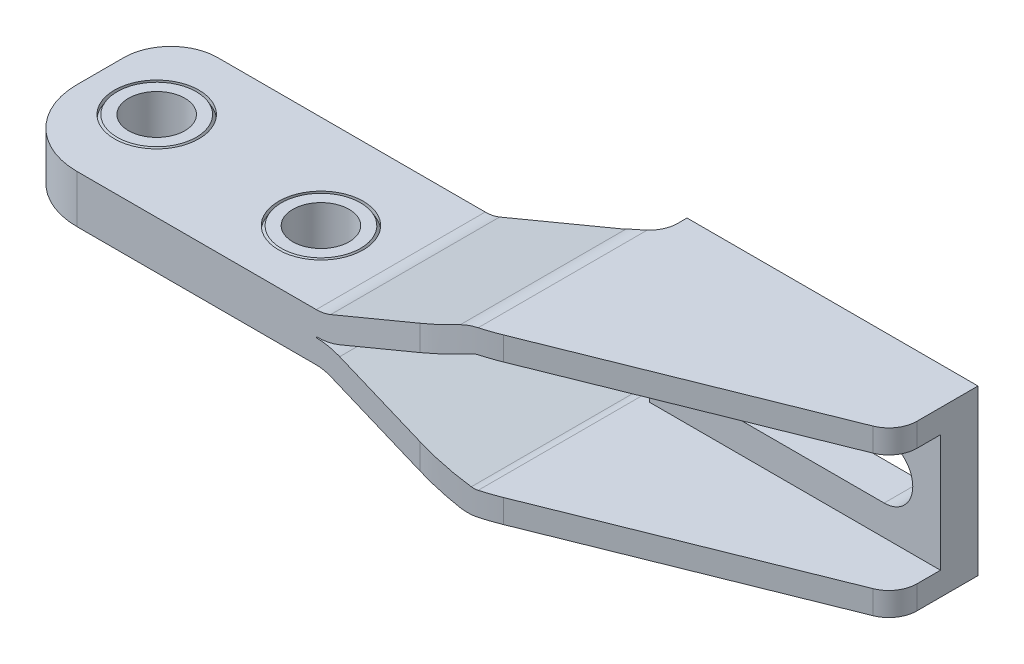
ISO-10303-21;
HEADER;
FILE_DESCRIPTION(('STEP AP214'),'2;1');
FILE_NAME('part.step','',(''),(''),'','','');
FILE_SCHEMA(('AUTOMOTIVE_DESIGN { 1 0 10303 214 1 1 1 1 }'));
ENDSEC;
DATA;
#1=APPLICATION_CONTEXT('core data for automotive mechanical design processes');
#2=APPLICATION_PROTOCOL_DEFINITION('international standard','automotive_design',2000,#1);
#3=PRODUCT_CONTEXT('',#1,'mechanical');
#4=PRODUCT('Part','Part','',(#3));
#5=PRODUCT_RELATED_PRODUCT_CATEGORY('part','',(#4));
#6=PRODUCT_DEFINITION_FORMATION('','',#4);
#7=PRODUCT_DEFINITION_CONTEXT('part definition',#1,'design');
#8=PRODUCT_DEFINITION('design','',#6,#7);
#9=PRODUCT_DEFINITION_SHAPE('','',#8);
#10=(LENGTH_UNIT() NAMED_UNIT(*) SI_UNIT(.MILLI.,.METRE.));
#11=(NAMED_UNIT(*) PLANE_ANGLE_UNIT() SI_UNIT($,.RADIAN.));
#12=(NAMED_UNIT(*) SI_UNIT($,.STERADIAN.) SOLID_ANGLE_UNIT());
#13=UNCERTAINTY_MEASURE_WITH_UNIT(LENGTH_MEASURE(1.E-05),#10,'distance_accuracy_value','');
#14=(GEOMETRIC_REPRESENTATION_CONTEXT(3) GLOBAL_UNCERTAINTY_ASSIGNED_CONTEXT((#13)) GLOBAL_UNIT_ASSIGNED_CONTEXT((#10,
#11,#12)) REPRESENTATION_CONTEXT('',''));
#15=CARTESIAN_POINT('',(0.,0.,0.));
#16=DIRECTION('',(0.,0.,1.));
#17=DIRECTION('',(1.,0.,0.));
#18=AXIS2_PLACEMENT_3D('',#15,#16,#17);
#19=CARTESIAN_POINT('',(19.,-2.55,1.5));
#20=DIRECTION('',(0.,1.,0.));
#21=DIRECTION('',(1.,0.,0.));
#22=AXIS2_PLACEMENT_3D('',#19,#20,#21);
#23=CYLINDRICAL_SURFACE('',#22,3.);
#24=CARTESIAN_POINT('',(19.,-2.55,1.5));
#25=DIRECTION('',(0.,1.,0.));
#26=DIRECTION('',(1.,0.,0.));
#27=AXIS2_PLACEMENT_3D('',#24,#25,#26);
#28=CIRCLE('',#27,3.);
#29=CARTESIAN_POINT('',(22.,-2.55,1.5));
#30=VERTEX_POINT('',#29);
#31=EDGE_CURVE('E314',#30,#30,#28,.T.);
#32=ORIENTED_EDGE('',*,*,#31,.F.);
#33=EDGE_LOOP('',(#32));
#34=FACE_BOUND('',#33,.T.);
#35=CARTESIAN_POINT('',(19.,2.55,1.5));
#36=DIRECTION('',(0.,1.,0.));
#37=DIRECTION('',(1.,0.,0.));
#38=AXIS2_PLACEMENT_3D('',#35,#36,#37);
#39=CIRCLE('',#38,3.);
#40=CARTESIAN_POINT('',(22.,2.55,1.5));
#41=VERTEX_POINT('',#40);
#42=EDGE_CURVE('E23',#41,#41,#39,.T.);
#43=ORIENTED_EDGE('',*,*,#42,.T.);
#44=EDGE_LOOP('',(#43));
#45=FACE_BOUND('',#44,.T.);
#46=ADVANCED_FACE('F14',(#34,#45),#23,.F.);
#47=CARTESIAN_POINT('',(19.,-2.55,-1.5));
#48=DIRECTION('',(0.,1.,0.));
#49=DIRECTION('',(1.,0.,0.));
#50=AXIS2_PLACEMENT_3D('',#47,#48,#49);
#51=PLANE('',#50);
#52=CARTESIAN_POINT('',(19.,-2.55,1.5));
#53=DIRECTION('',(0.,1.,0.));
#54=DIRECTION('',(1.,0.,0.));
#55=AXIS2_PLACEMENT_3D('',#52,#53,#54);
#56=CIRCLE('',#55,4.2113248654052);
#57=CARTESIAN_POINT('',(23.2113248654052,-2.55,1.5));
#58=VERTEX_POINT('',#57);
#59=EDGE_CURVE('E311',#58,#58,#56,.T.);
#60=ORIENTED_EDGE('',*,*,#59,.F.);
#61=EDGE_LOOP('',(#60));
#62=FACE_BOUND('',#61,.T.);
#63=ORIENTED_EDGE('',*,*,#31,.T.);
#64=EDGE_LOOP('',(#63));
#65=FACE_BOUND('',#64,.T.);
#66=ADVANCED_FACE('F1144',(#62,#65),#51,.F.);
#67=CARTESIAN_POINT('',(19.,-2.55,1.5));
#68=DIRECTION('',(0.,1.,0.));
#69=DIRECTION('',(1.,0.,0.));
#70=AXIS2_PLACEMENT_3D('',#67,#68,#69);
#71=CONICAL_SURFACE('',#70,4.2113248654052,0.523598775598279);
#72=CARTESIAN_POINT('',(19.,-2.05,1.5));
#73=DIRECTION('',(0.,1.,0.));
#74=DIRECTION('',(1.,0.,0.));
#75=AXIS2_PLACEMENT_3D('',#72,#73,#74);
#76=CIRCLE('',#75,4.5);
#77=CARTESIAN_POINT('',(23.5,-2.05,1.5));
#78=VERTEX_POINT('',#77);
#79=EDGE_CURVE('E307',#78,#78,#76,.T.);
#80=ORIENTED_EDGE('',*,*,#79,.F.);
#81=EDGE_LOOP('',(#80));
#82=FACE_BOUND('',#81,.T.);
#83=ORIENTED_EDGE('',*,*,#59,.T.);
#84=EDGE_LOOP('',(#83));
#85=FACE_BOUND('',#84,.T.);
#86=ADVANCED_FACE('F1133',(#82,#85),#71,.T.);
#87=CARTESIAN_POINT('',(19.,2.55,-2.7113248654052));
#88=DIRECTION('',(0.,-1.,0.));
#89=DIRECTION('',(-1.,0.,0.));
#90=AXIS2_PLACEMENT_3D('',#87,#88,#89);
#91=PLANE('',#90);
#92=ORIENTED_EDGE('',*,*,#42,.F.);
#93=EDGE_LOOP('',(#92));
#94=FACE_BOUND('',#93,.T.);
#95=CARTESIAN_POINT('',(19.,2.55,1.5));
#96=DIRECTION('',(0.,1.,0.));
#97=DIRECTION('',(1.,0.,0.));
#98=AXIS2_PLACEMENT_3D('',#95,#96,#97);
#99=CIRCLE('',#98,4.2113248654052);
#100=CARTESIAN_POINT('',(23.2113248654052,2.55,1.5));
#101=VERTEX_POINT('',#100);
#102=EDGE_CURVE('E9',#101,#101,#99,.T.);
#103=ORIENTED_EDGE('',*,*,#102,.T.);
#104=EDGE_LOOP('',(#103));
#105=FACE_BOUND('',#104,.T.);
#106=ADVANCED_FACE('F1122',(#94,#105),#91,.F.);
#107=CARTESIAN_POINT('',(19.,2.05,1.5));
#108=DIRECTION('',(0.,-1.,0.));
#109=DIRECTION('',(-1.,0.,0.));
#110=AXIS2_PLACEMENT_3D('',#107,#108,#109);
#111=CONICAL_SURFACE('',#110,4.5,0.52359877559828);
#112=ORIENTED_EDGE('',*,*,#102,.F.);
#113=EDGE_LOOP('',(#112));
#114=FACE_BOUND('',#113,.T.);
#115=CARTESIAN_POINT('',(19.,2.05,1.5));
#116=DIRECTION('',(0.,1.,0.));
#117=DIRECTION('',(1.,0.,0.));
#118=AXIS2_PLACEMENT_3D('',#115,#116,#117);
#119=CIRCLE('',#118,4.5);
#120=CARTESIAN_POINT('',(23.5,2.05,1.5));
#121=VERTEX_POINT('',#120);
#122=EDGE_CURVE('E304',#121,#121,#119,.T.);
#123=ORIENTED_EDGE('',*,*,#122,.T.);
#124=EDGE_LOOP('',(#123));
#125=FACE_BOUND('',#124,.T.);
#126=ADVANCED_FACE('F957',(#114,#125),#111,.T.);
#127=CARTESIAN_POINT('',(0.,-2.55,0.));
#128=DIRECTION('',(0.,1.,0.));
#129=DIRECTION('',(1.,0.,0.));
#130=AXIS2_PLACEMENT_3D('',#127,#128,#129);
#131=CYLINDRICAL_SURFACE('',#130,3.);
#132=CARTESIAN_POINT('',(0.,-2.55,0.));
#133=DIRECTION('',(0.,1.,0.));
#134=DIRECTION('',(1.,0.,0.));
#135=AXIS2_PLACEMENT_3D('',#132,#133,#134);
#136=CIRCLE('',#135,3.);
#137=CARTESIAN_POINT('',(3.,-2.55,0.));
#138=VERTEX_POINT('',#137);
#139=EDGE_CURVE('E328',#138,#138,#136,.T.);
#140=ORIENTED_EDGE('',*,*,#139,.F.);
#141=EDGE_LOOP('',(#140));
#142=FACE_BOUND('',#141,.T.);
#143=CARTESIAN_POINT('',(0.,2.55,0.));
#144=DIRECTION('',(0.,1.,0.));
#145=DIRECTION('',(1.,0.,0.));
#146=AXIS2_PLACEMENT_3D('',#143,#144,#145);
#147=CIRCLE('',#146,3.);
#148=CARTESIAN_POINT('',(3.,2.55,0.));
#149=VERTEX_POINT('',#148);
#150=EDGE_CURVE('E331',#149,#149,#147,.T.);
#151=ORIENTED_EDGE('',*,*,#150,.T.);
#152=EDGE_LOOP('',(#151));
#153=FACE_BOUND('',#152,.T.);
#154=ADVANCED_FACE('F1065',(#142,#153),#131,.F.);
#155=CARTESIAN_POINT('',(69.,0.,-12.5));
#156=DIRECTION('',(0.,0.,1.));
#157=DIRECTION('',(0.,1.,0.));
#158=AXIS2_PLACEMENT_3D('',#155,#156,#157);
#159=CYLINDRICAL_SURFACE('',#158,3.05);
#160=CARTESIAN_POINT('',(69.,0.,-8.5));
#161=DIRECTION('',(0.,0.,1.));
#162=DIRECTION('',(-1.,0.,0.));
#163=AXIS2_PLACEMENT_3D('',#160,#161,#162);
#164=CIRCLE('',#163,3.05);
#165=CARTESIAN_POINT('',(69.,-3.05,-8.5));
#166=VERTEX_POINT('',#165);
#167=CARTESIAN_POINT('',(69.,3.05,-8.5));
#168=VERTEX_POINT('',#167);
#169=EDGE_CURVE('E348',#166,#168,#164,.T.);
#170=ORIENTED_EDGE('',*,*,#169,.T.);
#171=DIRECTION('',(0.,0.,1.));
#172=VECTOR('',#171,1.);
#173=CARTESIAN_POINT('',(69.,3.05,-12.5));
#174=LINE('',#173,#172);
#175=CARTESIAN_POINT('',(69.,3.05,-12.5));
#176=VERTEX_POINT('',#175);
#177=EDGE_CURVE('E375',#176,#168,#174,.T.);
#178=ORIENTED_EDGE('',*,*,#177,.F.);
#179=CARTESIAN_POINT('',(69.,0.,-12.5));
#180=DIRECTION('',(0.,0.,1.));
#181=DIRECTION('',(-1.,0.,0.));
#182=AXIS2_PLACEMENT_3D('',#179,#180,#181);
#183=CIRCLE('',#182,3.05);
#184=CARTESIAN_POINT('',(69.,-3.05,-12.5));
#185=VERTEX_POINT('',#184);
#186=EDGE_CURVE('E361',#185,#176,#183,.T.);
#187=ORIENTED_EDGE('',*,*,#186,.F.);
#188=DIRECTION('',(0.,0.,1.));
#189=VECTOR('',#188,1.);
#190=CARTESIAN_POINT('',(69.,-3.05,-12.5));
#191=LINE('',#190,#189);
#192=EDGE_CURVE('E377',#185,#166,#191,.T.);
#193=ORIENTED_EDGE('',*,*,#192,.T.);
#194=EDGE_LOOP('',(#170,#178,#187,#193));
#195=FACE_BOUND('',#194,.T.);
#196=ADVANCED_FACE('F1075',(#195),#159,.F.);
#197=CARTESIAN_POINT('',(69.,3.05,-12.5));
#198=DIRECTION('',(0.,1.,0.));
#199=DIRECTION('',(-1.,0.,0.));
#200=AXIS2_PLACEMENT_3D('',#197,#198,#199);
#201=PLANE('',#200);
#202=DIRECTION('',(-1.,0.,0.));
#203=VECTOR('',#202,1.);
#204=CARTESIAN_POINT('',(69.,3.05,-8.5));
#205=LINE('',#204,#203);
#206=CARTESIAN_POINT('',(50.,3.05,-8.5));
#207=VERTEX_POINT('',#206);
#208=EDGE_CURVE('E39',#168,#207,#205,.T.);
#209=ORIENTED_EDGE('',*,*,#208,.T.);
#210=DIRECTION('',(0.,0.,1.));
#211=VECTOR('',#210,1.);
#212=CARTESIAN_POINT('',(50.,3.05,-12.5));
#213=LINE('',#212,#211);
#214=CARTESIAN_POINT('',(50.,3.05,-12.5));
#215=VERTEX_POINT('',#214);
#216=EDGE_CURVE('E373',#215,#207,#213,.T.);
#217=ORIENTED_EDGE('',*,*,#216,.F.);
#218=DIRECTION('',(-1.,0.,0.));
#219=VECTOR('',#218,1.);
#220=CARTESIAN_POINT('',(69.,3.05,-12.5));
#221=LINE('',#220,#219);
#222=EDGE_CURVE('E364',#176,#215,#221,.T.);
#223=ORIENTED_EDGE('',*,*,#222,.F.);
#224=ORIENTED_EDGE('',*,*,#177,.T.);
#225=EDGE_LOOP('',(#209,#217,#223,#224));
#226=FACE_BOUND('',#225,.T.);
#227=ADVANCED_FACE('F1084',(#226),#201,.F.);
#228=CARTESIAN_POINT('',(50.,0.,-12.5));
#229=DIRECTION('',(0.,0.,1.));
#230=DIRECTION('',(0.,1.,0.));
#231=AXIS2_PLACEMENT_3D('',#228,#229,#230);
#232=CYLINDRICAL_SURFACE('',#231,3.05);
#233=CARTESIAN_POINT('',(50.,0.,-8.5));
#234=DIRECTION('',(0.,0.,1.));
#235=DIRECTION('',(1.,0.,0.));
#236=AXIS2_PLACEMENT_3D('',#233,#234,#235);
#237=CIRCLE('',#236,3.05);
#238=CARTESIAN_POINT('',(50.,-3.05,-8.5));
#239=VERTEX_POINT('',#238);
#240=EDGE_CURVE('E354',#207,#239,#237,.T.);
#241=ORIENTED_EDGE('',*,*,#240,.T.);
#242=DIRECTION('',(0.,0.,1.));
#243=VECTOR('',#242,1.);
#244=CARTESIAN_POINT('',(50.,-3.05,-12.5));
#245=LINE('',#244,#243);
#246=CARTESIAN_POINT('',(50.,-3.05,-12.5));
#247=VERTEX_POINT('',#246);
#248=EDGE_CURVE('E370',#247,#239,#245,.T.);
#249=ORIENTED_EDGE('',*,*,#248,.F.);
#250=CARTESIAN_POINT('',(50.,0.,-12.5));
#251=DIRECTION('',(0.,0.,1.));
#252=DIRECTION('',(1.,0.,0.));
#253=AXIS2_PLACEMENT_3D('',#250,#251,#252);
#254=CIRCLE('',#253,3.05);
#255=EDGE_CURVE('E367',#215,#247,#254,.T.);
#256=ORIENTED_EDGE('',*,*,#255,.F.);
#257=ORIENTED_EDGE('',*,*,#216,.T.);
#258=EDGE_LOOP('',(#241,#249,#256,#257));
#259=FACE_BOUND('',#258,.T.);
#260=ADVANCED_FACE('F1074',(#259),#232,.F.);
#261=CARTESIAN_POINT('',(50.,-3.05,-12.5));
#262=DIRECTION('',(0.,-1.,0.));
#263=DIRECTION('',(1.,0.,0.));
#264=AXIS2_PLACEMENT_3D('',#261,#262,#263);
#265=PLANE('',#264);
#266=DIRECTION('',(1.,0.,0.));
#267=VECTOR('',#266,1.);
#268=CARTESIAN_POINT('',(50.,-3.05,-8.5));
#269=LINE('',#268,#267);
#270=EDGE_CURVE('E347',#239,#166,#269,.T.);
#271=ORIENTED_EDGE('',*,*,#270,.T.);
#272=ORIENTED_EDGE('',*,*,#192,.F.);
#273=DIRECTION('',(1.,0.,0.));
#274=VECTOR('',#273,1.);
#275=CARTESIAN_POINT('',(50.,-3.05,-12.5));
#276=LINE('',#275,#274);
#277=EDGE_CURVE('E31',#247,#185,#276,.T.);
#278=ORIENTED_EDGE('',*,*,#277,.F.);
#279=ORIENTED_EDGE('',*,*,#248,.T.);
#280=EDGE_LOOP('',(#271,#272,#278,#279));
#281=FACE_BOUND('',#280,.T.);
#282=ADVANCED_FACE('F405',(#281),#265,.F.);
#283=CARTESIAN_POINT('',(0.,2.55,-4.2113248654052));
#284=DIRECTION('',(0.,-1.,0.));
#285=DIRECTION('',(-1.,0.,0.));
#286=AXIS2_PLACEMENT_3D('',#283,#284,#285);
#287=PLANE('',#286);
#288=ORIENTED_EDGE('',*,*,#150,.F.);
#289=EDGE_LOOP('',(#288));
#290=FACE_BOUND('',#289,.T.);
#291=CARTESIAN_POINT('',(0.,2.55,0.));
#292=DIRECTION('',(0.,1.,0.));
#293=DIRECTION('',(1.,0.,0.));
#294=AXIS2_PLACEMENT_3D('',#291,#292,#293);
#295=CIRCLE('',#294,4.2113248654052);
#296=CARTESIAN_POINT('',(4.2113248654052,2.55,0.));
#297=VERTEX_POINT('',#296);
#298=EDGE_CURVE('E308',#297,#297,#295,.T.);
#299=ORIENTED_EDGE('',*,*,#298,.T.);
#300=EDGE_LOOP('',(#299));
#301=FACE_BOUND('',#300,.T.);
#302=ADVANCED_FACE('F874',(#290,#301),#287,.F.);
#303=CARTESIAN_POINT('',(72.0000000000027,-8.75,-5.99999999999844));
#304=DIRECTION('',(0.,1.,0.));
#305=DIRECTION('',(-1.,0.,0.));
#306=AXIS2_PLACEMENT_3D('',#303,#304,#305);
#307=CYLINDRICAL_SURFACE('',#306,2.99999999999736);
#308=DIRECTION('',(0.,1.,0.));
#309=VECTOR('',#308,1.);
#310=CARTESIAN_POINT('',(73.117505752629,-8.75,-3.2159057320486));
#311=LINE('',#310,#309);
#312=CARTESIAN_POINT('',(73.117505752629,6.25,-3.2159057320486));
#313=VERTEX_POINT('',#312);
#314=CARTESIAN_POINT('',(73.117505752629,8.75,-3.2159057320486));
#315=VERTEX_POINT('',#314);
#316=EDGE_CURVE('E638',#313,#315,#311,.T.);
#317=ORIENTED_EDGE('',*,*,#316,.F.);
#318=CARTESIAN_POINT('',(72.0000000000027,6.25,-5.99999999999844));
#319=DIRECTION('',(0.,-1.,0.));
#320=DIRECTION('',(1.,0.,0.));
#321=AXIS2_PLACEMENT_3D('',#318,#319,#320);
#322=CIRCLE('',#321,2.99999999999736);
#323=CARTESIAN_POINT('',(75.,6.25,-6.));
#324=VERTEX_POINT('',#323);
#325=EDGE_CURVE('E688',#313,#324,#322,.F.);
#326=ORIENTED_EDGE('',*,*,#325,.T.);
#327=DIRECTION('',(0.,1.,0.));
#328=VECTOR('',#327,1.);
#329=CARTESIAN_POINT('',(75.,-8.75,-6.));
#330=LINE('',#329,#328);
#331=CARTESIAN_POINT('',(75.,8.75,-6.));
#332=VERTEX_POINT('',#331);
#333=EDGE_CURVE('E632',#324,#332,#330,.T.);
#334=ORIENTED_EDGE('',*,*,#333,.T.);
#335=CARTESIAN_POINT('',(72.0000000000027,8.75,-5.99999999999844));
#336=DIRECTION('',(0.,1.,0.));
#337=DIRECTION('',(-1.,0.,0.));
#338=AXIS2_PLACEMENT_3D('',#335,#336,#337);
#339=CIRCLE('',#338,2.99999999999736);
#340=EDGE_CURVE('E609',#315,#332,#339,.T.);
#341=ORIENTED_EDGE('',*,*,#340,.F.);
#342=EDGE_LOOP('',(#317,#326,#334,#341));
#343=FACE_BOUND('',#342,.T.);
#344=ADVANCED_FACE('F848',(#343),#307,.T.);
#345=CARTESIAN_POINT('',(0.,-2.55,-3.));
#346=DIRECTION('',(0.,1.,0.));
#347=DIRECTION('',(1.,0.,0.));
#348=AXIS2_PLACEMENT_3D('',#345,#346,#347);
#349=PLANE('',#348);
#350=CARTESIAN_POINT('',(0.,-2.55,0.));
#351=DIRECTION('',(0.,1.,0.));
#352=DIRECTION('',(1.,0.,0.));
#353=AXIS2_PLACEMENT_3D('',#350,#351,#352);
#354=CIRCLE('',#353,4.2113248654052);
#355=CARTESIAN_POINT('',(4.2113248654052,-2.55,0.));
#356=VERTEX_POINT('',#355);
#357=EDGE_CURVE('E325',#356,#356,#354,.T.);
#358=ORIENTED_EDGE('',*,*,#357,.F.);
#359=EDGE_LOOP('',(#358));
#360=FACE_BOUND('',#359,.T.);
#361=ORIENTED_EDGE('',*,*,#139,.T.);
#362=EDGE_LOOP('',(#361));
#363=FACE_BOUND('',#362,.T.);
#364=ADVANCED_FACE('F873',(#360,#363),#349,.F.);
#365=CARTESIAN_POINT('',(75.,-8.75,-12.5));
#366=DIRECTION('',(0.,0.,-1.));
#367=DIRECTION('',(0.,-1.,0.));
#368=AXIS2_PLACEMENT_3D('',#365,#366,#367);
#369=PLANE('',#368);
#370=ORIENTED_EDGE('',*,*,#277,.T.);
#371=ORIENTED_EDGE('',*,*,#186,.T.);
#372=ORIENTED_EDGE('',*,*,#222,.T.);
#373=ORIENTED_EDGE('',*,*,#255,.T.);
#374=EDGE_LOOP('',(#370,#371,#372,#373));
#375=FACE_BOUND('',#374,.T.);
#376=DIRECTION('',(0.,1.,0.));
#377=VECTOR('',#376,1.);
#378=CARTESIAN_POINT('',(44.,-8.75,-12.5));
#379=LINE('',#378,#377);
#380=CARTESIAN_POINT('',(44.,-8.75,-12.5));
#381=VERTEX_POINT('',#380);
#382=CARTESIAN_POINT('',(44.,8.75,-12.5));
#383=VERTEX_POINT('',#382);
#384=EDGE_CURVE('E666',#381,#383,#379,.T.);
#385=ORIENTED_EDGE('',*,*,#384,.T.);
#386=DIRECTION('',(-1.,0.,0.));
#387=VECTOR('',#386,1.);
#388=CARTESIAN_POINT('',(75.,8.75,-12.5));
#389=LINE('',#388,#387);
#390=CARTESIAN_POINT('',(75.,8.75,-12.5));
#391=VERTEX_POINT('',#390);
#392=EDGE_CURVE('E594',#391,#383,#389,.T.);
#393=ORIENTED_EDGE('',*,*,#392,.F.);
#394=DIRECTION('',(0.,1.,0.));
#395=VECTOR('',#394,1.);
#396=CARTESIAN_POINT('',(75.,-8.75,-12.5));
#397=LINE('',#396,#395);
#398=CARTESIAN_POINT('',(75.,-8.75,-12.5));
#399=VERTEX_POINT('',#398);
#400=EDGE_CURVE('E668',#399,#391,#397,.T.);
#401=ORIENTED_EDGE('',*,*,#400,.F.);
#402=DIRECTION('',(-1.,0.,0.));
#403=VECTOR('',#402,1.);
#404=CARTESIAN_POINT('',(75.,-8.75,-12.5));
#405=LINE('',#404,#403);
#406=EDGE_CURVE('E615',#399,#381,#405,.T.);
#407=ORIENTED_EDGE('',*,*,#406,.T.);
#408=EDGE_LOOP('',(#385,#393,#401,#407));
#409=FACE_BOUND('',#408,.T.);
#410=ADVANCED_FACE('F854',(#375,#409),#369,.T.);
#411=CARTESIAN_POINT('',(43.,4.75000000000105,-8.5));
#412=DIRECTION('',(0.,0.,1.));
#413=DIRECTION('',(0.,1.,0.));
#414=AXIS2_PLACEMENT_3D('',#411,#412,#413);
#415=PLANE('',#414);
#416=ORIENTED_EDGE('',*,*,#270,.F.);
#417=ORIENTED_EDGE('',*,*,#240,.F.);
#418=ORIENTED_EDGE('',*,*,#208,.F.);
#419=ORIENTED_EDGE('',*,*,#169,.F.);
#420=EDGE_LOOP('',(#416,#417,#418,#419));
#421=FACE_BOUND('',#420,.T.);
#422=DIRECTION('',(0.,1.,0.));
#423=VECTOR('',#422,1.);
#424=CARTESIAN_POINT('',(44.,-6.25,-8.5));
#425=LINE('',#424,#423);
#426=CARTESIAN_POINT('',(44.,-6.25,-8.5));
#427=VERTEX_POINT('',#426);
#428=CARTESIAN_POINT('',(44.,6.25,-8.5));
#429=VERTEX_POINT('',#428);
#430=EDGE_CURVE('E379',#427,#429,#425,.T.);
#431=ORIENTED_EDGE('',*,*,#430,.F.);
#432=DIRECTION('',(1.,0.,0.));
#433=VECTOR('',#432,1.);
#434=CARTESIAN_POINT('',(43.,-6.25,-8.5));
#435=LINE('',#434,#433);
#436=CARTESIAN_POINT('',(75.,-6.25,-8.5));
#437=VERTEX_POINT('',#436);
#438=EDGE_CURVE('E425',#427,#437,#435,.T.);
#439=ORIENTED_EDGE('',*,*,#438,.T.);
#440=DIRECTION('',(0.,-1.,0.));
#441=VECTOR('',#440,1.);
#442=CARTESIAN_POINT('',(75.,-8.75,-8.5));
#443=LINE('',#442,#441);
#444=CARTESIAN_POINT('',(75.,6.25,-8.5));
#445=VERTEX_POINT('',#444);
#446=EDGE_CURVE('E694',#445,#437,#443,.T.);
#447=ORIENTED_EDGE('',*,*,#446,.F.);
#448=DIRECTION('',(-1.,0.,0.));
#449=VECTOR('',#448,1.);
#450=CARTESIAN_POINT('',(80.,6.25,-8.5));
#451=LINE('',#450,#449);
#452=EDGE_CURVE('E426',#445,#429,#451,.T.);
#453=ORIENTED_EDGE('',*,*,#452,.T.);
#454=EDGE_LOOP('',(#431,#439,#447,#453));
#455=FACE_BOUND('',#454,.T.);
#456=ADVANCED_FACE('F409',(#421,#455),#415,.T.);
#457=CARTESIAN_POINT('',(75.,-8.75,-6.));
#458=DIRECTION('',(1.,0.,0.));
#459=DIRECTION('',(0.,1.,0.));
#460=AXIS2_PLACEMENT_3D('',#457,#458,#459);
#461=PLANE('',#460);
#462=ORIENTED_EDGE('',*,*,#446,.T.);
#463=DIRECTION('',(0.,0.,1.));
#464=VECTOR('',#463,1.);
#465=CARTESIAN_POINT('',(75.,-6.25,-6.));
#466=LINE('',#465,#464);
#467=CARTESIAN_POINT('',(75.,-6.25,-6.));
#468=VERTEX_POINT('',#467);
#469=EDGE_CURVE('E463',#437,#468,#466,.T.);
#470=ORIENTED_EDGE('',*,*,#469,.T.);
#471=CARTESIAN_POINT('',(75.,-8.75,-6.));
#472=VERTEX_POINT('',#471);
#473=EDGE_CURVE('E635',#472,#468,#330,.T.);
#474=ORIENTED_EDGE('',*,*,#473,.F.);
#475=DIRECTION('',(0.,0.,-1.));
#476=VECTOR('',#475,1.);
#477=CARTESIAN_POINT('',(75.,-8.75,-6.));
#478=LINE('',#477,#476);
#479=EDGE_CURVE('E612',#472,#399,#478,.T.);
#480=ORIENTED_EDGE('',*,*,#479,.T.);
#481=ORIENTED_EDGE('',*,*,#400,.T.);
#482=DIRECTION('',(0.,0.,-1.));
#483=VECTOR('',#482,1.);
#484=CARTESIAN_POINT('',(75.,8.75,-6.));
#485=LINE('',#484,#483);
#486=EDGE_CURVE('E593',#332,#391,#485,.T.);
#487=ORIENTED_EDGE('',*,*,#486,.F.);
#488=ORIENTED_EDGE('',*,*,#333,.F.);
#489=DIRECTION('',(0.,0.,-1.));
#490=VECTOR('',#489,1.);
#491=CARTESIAN_POINT('',(75.,6.25,-6.));
#492=LINE('',#491,#490);
#493=EDGE_CURVE('E454',#324,#445,#492,.T.);
#494=ORIENTED_EDGE('',*,*,#493,.T.);
#495=EDGE_LOOP('',(#462,#470,#474,#480,#481,#487,#488,#494));
#496=FACE_BOUND('',#495,.T.);
#497=ADVANCED_FACE('F16',(#496),#461,.T.);
#498=ORIENTED_EDGE('',*,*,#473,.T.);
#499=CARTESIAN_POINT('',(72.0000000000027,-6.25,-5.99999999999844));
#500=DIRECTION('',(0.,1.,0.));
#501=DIRECTION('',(-1.,0.,0.));
#502=AXIS2_PLACEMENT_3D('',#499,#500,#501);
#503=CIRCLE('',#502,2.99999999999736);
#504=CARTESIAN_POINT('',(73.117505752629,-6.25,-3.2159057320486));
#505=VERTEX_POINT('',#504);
#506=EDGE_CURVE('E691',#468,#505,#503,.F.);
#507=ORIENTED_EDGE('',*,*,#506,.T.);
#508=CARTESIAN_POINT('',(73.117505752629,-8.75,-3.2159057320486));
#509=VERTEX_POINT('',#508);
#510=EDGE_CURVE('E639',#509,#505,#311,.T.);
#511=ORIENTED_EDGE('',*,*,#510,.F.);
#512=CARTESIAN_POINT('',(72.0000000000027,-8.75,-5.99999999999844));
#513=DIRECTION('',(0.,1.,0.));
#514=DIRECTION('',(-1.,0.,0.));
#515=AXIS2_PLACEMENT_3D('',#512,#513,#514);
#516=CIRCLE('',#515,2.99999999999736);
#517=EDGE_CURVE('E629',#509,#472,#516,.T.);
#518=ORIENTED_EDGE('',*,*,#517,.T.);
#519=EDGE_LOOP('',(#498,#507,#511,#518));
#520=FACE_BOUND('',#519,.T.);
#521=ADVANCED_FACE('F861',(#520),#307,.T.);
#522=CARTESIAN_POINT('',(0.,2.05,0.));
#523=DIRECTION('',(0.,-1.,0.));
#524=DIRECTION('',(-1.,0.,0.));
#525=AXIS2_PLACEMENT_3D('',#522,#523,#524);
#526=CONICAL_SURFACE('',#525,4.5,0.52359877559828);
#527=ORIENTED_EDGE('',*,*,#298,.F.);
#528=EDGE_LOOP('',(#527));
#529=FACE_BOUND('',#528,.T.);
#530=CARTESIAN_POINT('',(0.,2.05,0.));
#531=DIRECTION('',(0.,1.,0.));
#532=DIRECTION('',(1.,0.,0.));
#533=AXIS2_PLACEMENT_3D('',#530,#531,#532);
#534=CIRCLE('',#533,4.5);
#535=CARTESIAN_POINT('',(4.5,2.05,0.));
#536=VERTEX_POINT('',#535);
#537=EDGE_CURVE('E319',#536,#536,#534,.T.);
#538=ORIENTED_EDGE('',*,*,#537,.T.);
#539=EDGE_LOOP('',(#538));
#540=FACE_BOUND('',#539,.T.);
#541=ADVANCED_FACE('F863',(#529,#540),#526,.T.);
#542=CARTESIAN_POINT('',(45.023749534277,-8.75,8.0606284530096));
#543=DIRECTION('',(0.372501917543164,0.,0.928031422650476));
#544=DIRECTION('',(0.928031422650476,0.,-0.372501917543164));
#545=AXIS2_PLACEMENT_3D('',#542,#543,#544);
#546=PLANE('',#545);
#547=DIRECTION('',(0.,1.,0.));
#548=VECTOR('',#547,1.);
#549=CARTESIAN_POINT('',(45.023749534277,-8.75,8.0606284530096));
#550=LINE('',#549,#548);
#551=CARTESIAN_POINT('',(45.023749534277,6.25,8.0606284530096));
#552=VERTEX_POINT('',#551);
#553=CARTESIAN_POINT('',(45.023749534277,8.75,8.0606284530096));
#554=VERTEX_POINT('',#553);
#555=EDGE_CURVE('E642',#552,#554,#550,.T.);
#556=ORIENTED_EDGE('',*,*,#555,.F.);
#557=DIRECTION('',(0.928031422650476,0.,-0.372501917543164));
#558=VECTOR('',#557,1.);
#559=CARTESIAN_POINT('',(45.023749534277,6.25,8.0606284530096));
#560=LINE('',#559,#558);
#561=EDGE_CURVE('E451',#552,#313,#560,.T.);
#562=ORIENTED_EDGE('',*,*,#561,.T.);
#563=ORIENTED_EDGE('',*,*,#316,.T.);
#564=DIRECTION('',(0.928031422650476,0.,-0.372501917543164));
#565=VECTOR('',#564,1.);
#566=CARTESIAN_POINT('',(45.023749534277,8.75,8.0606284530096));
#567=LINE('',#566,#565);
#568=EDGE_CURVE('E606',#554,#315,#567,.T.);
#569=ORIENTED_EDGE('',*,*,#568,.F.);
#570=EDGE_LOOP('',(#556,#562,#563,#569));
#571=FACE_BOUND('',#570,.T.);
#572=ADVANCED_FACE('F845',(#571),#546,.T.);
#573=CARTESIAN_POINT('',(41.0000000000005,8.75,-11.4999999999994));
#574=DIRECTION('',(0.,-1.,0.));
#575=DIRECTION('',(1.,0.,0.));
#576=AXIS2_PLACEMENT_3D('',#573,#574,#575);
#577=PLANE('',#576);
#578=DIRECTION('',(0.,0.,-1.));
#579=VECTOR('',#578,1.);
#580=CARTESIAN_POINT('',(43.,8.75,11.5));
#581=LINE('',#580,#579);
#582=CARTESIAN_POINT('',(42.9999999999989,8.75,8.74981531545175));
#583=VERTEX_POINT('',#582);
#584=CARTESIAN_POINT('',(43.,8.75,-9.26393202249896));
#585=VERTEX_POINT('',#584);
#586=EDGE_CURVE('E475',#583,#585,#581,.T.);
#587=ORIENTED_EDGE('',*,*,#586,.F.);
#588=CARTESIAN_POINT('',(37.5737111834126,8.75,-10.5000000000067));
#589=DIRECTION('',(0.,1.,0.));
#590=DIRECTION('',(-1.,0.,0.));
#591=AXIS2_PLACEMENT_3D('',#588,#589,#590);
#592=CIRCLE('',#591,20.0000000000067);
#593=EDGE_CURVE('E603',#583,#554,#592,.T.);
#594=ORIENTED_EDGE('',*,*,#593,.T.);
#595=ORIENTED_EDGE('',*,*,#568,.T.);
#596=ORIENTED_EDGE('',*,*,#340,.T.);
#597=ORIENTED_EDGE('',*,*,#486,.T.);
#598=ORIENTED_EDGE('',*,*,#392,.T.);
#599=DIRECTION('',(0.,0.,1.));
#600=VECTOR('',#599,1.);
#601=CARTESIAN_POINT('',(44.,8.75,-12.5));
#602=LINE('',#601,#600);
#603=CARTESIAN_POINT('',(44.,8.75,-11.5));
#604=VERTEX_POINT('',#603);
#605=EDGE_CURVE('E597',#383,#604,#602,.T.);
#606=ORIENTED_EDGE('',*,*,#605,.T.);
#607=CARTESIAN_POINT('',(41.0000000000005,8.75,-11.4999999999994));
#608=DIRECTION('',(0.,-1.,0.));
#609=DIRECTION('',(-1.,0.,0.));
#610=AXIS2_PLACEMENT_3D('',#607,#608,#609);
#611=CIRCLE('',#610,2.99999999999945);
#612=EDGE_CURVE('E600',#604,#585,#611,.T.);
#613=ORIENTED_EDGE('',*,*,#612,.T.);
#614=EDGE_LOOP('',(#587,#594,#595,#596,#597,#598,#606,#613));
#615=FACE_BOUND('',#614,.T.);
#616=ADVANCED_FACE('F511',(#615),#577,.F.);
#617=CARTESIAN_POINT('',(42.9999999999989,4.75000000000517,11.5));
#618=DIRECTION('',(0.,0.,-1.));
#619=DIRECTION('',(0.,-1.,0.));
#620=AXIS2_PLACEMENT_3D('',#617,#618,#619);
#621=CYLINDRICAL_SURFACE('',#620,3.99999999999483);
#622=DIRECTION('',(0.,0.,-1.));
#623=VECTOR('',#622,1.);
#624=CARTESIAN_POINT('',(41.463491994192,8.4431210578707,11.5));
#625=LINE('',#624,#623);
#626=CARTESIAN_POINT('',(41.463491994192,8.4431210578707,9.11809382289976));
#627=VERTEX_POINT('',#626);
#628=CARTESIAN_POINT('',(41.463491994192,8.4431210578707,-8.53602038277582));
#629=VERTEX_POINT('',#628);
#630=EDGE_CURVE('E477',#627,#629,#625,.T.);
#631=ORIENTED_EDGE('',*,*,#630,.F.);
#632=CARTESIAN_POINT('',(43.,8.75,8.74981531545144));
#633=CARTESIAN_POINT('',(42.8694447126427,8.75002129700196,8.78663508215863));
#634=CARTESIAN_POINT('',(42.7384895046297,8.74360744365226,8.82209802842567));
#635=CARTESIAN_POINT('',(42.4783543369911,8.71796707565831,8.88974455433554));
#636=CARTESIAN_POINT('',(42.3491694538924,8.69886501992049,8.92195652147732));
#637=CARTESIAN_POINT('',(42.0925673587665,8.64790602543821,8.98325802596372));
#638=CARTESIAN_POINT('',(41.9651502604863,8.61604826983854,9.01234736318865));
#639=CARTESIAN_POINT('',(41.7122055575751,8.53936332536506,9.06757382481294));
#640=CARTESIAN_POINT('',(41.5867085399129,8.49441256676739,9.09367935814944));
#641=CARTESIAN_POINT('',(41.463491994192,8.4431210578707,9.11809382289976));
#642=B_SPLINE_CURVE_WITH_KNOTS('',3,(#632,#633,#634,#635,#636,#637,#638,#639,#640,#641),
.UNSPECIFIED.,.F.,.F.,(4,2,2,2,4),(0.,0.406808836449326,0.809685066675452,1.21258710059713,
1.61942220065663),.UNSPECIFIED.);
#643=EDGE_CURVE('E486',#583,#627,#642,.T.);
#644=ORIENTED_EDGE('',*,*,#643,.F.);
#645=ORIENTED_EDGE('',*,*,#586,.T.);
#646=CARTESIAN_POINT('',(41.463491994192,8.4431210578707,-8.53602038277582));
#647=CARTESIAN_POINT('',(41.5305677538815,8.47104614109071,-8.54649302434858));
#648=CARTESIAN_POINT('',(41.5981008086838,8.4969811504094,-8.5594018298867));
#649=CARTESIAN_POINT('',(41.7334420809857,8.54485792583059,-8.59021411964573));
#650=CARTESIAN_POINT('',(41.8012503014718,8.56679964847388,-8.60811765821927));
#651=CARTESIAN_POINT('',(41.9345654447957,8.60610548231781,-8.6484558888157));
#652=CARTESIAN_POINT('',(42.0000826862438,8.62358263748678,-8.67074622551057));
#653=CARTESIAN_POINT('',(42.1301600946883,8.65484959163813,-8.72014816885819));
#654=CARTESIAN_POINT('',(42.1947203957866,8.6686399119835,-8.74725909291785));
#655=CARTESIAN_POINT('',(42.324186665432,8.69306266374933,-8.80709021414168));
#656=CARTESIAN_POINT('',(42.3890470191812,8.70359036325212,-8.83995186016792));
#657=CARTESIAN_POINT('',(42.5165717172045,8.72120172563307,-8.91053580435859));
#658=CARTESIAN_POINT('',(42.5792354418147,8.72828442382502,-8.94825946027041));
#659=CARTESIAN_POINT('',(42.7036870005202,8.73951346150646,-9.02954730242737));
#660=CARTESIAN_POINT('',(42.7653899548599,8.74356374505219,-9.07325443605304));
#661=CARTESIAN_POINT('',(42.8853726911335,8.74880969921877,-9.16524033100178));
#662=CARTESIAN_POINT('',(42.9436541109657,8.75000674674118,-9.21351687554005));
#663=CARTESIAN_POINT('',(43.,8.75,-9.26393202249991));
#664=B_SPLINE_CURVE_WITH_KNOTS('',3,(#646,#647,#648,#649,#650,#651,#652,#653,#654,#655,#656,
#657,#658,#659,#660,#661,#662,#663),.UNSPECIFIED.,.F.,.F.,(4,2,2,2,2,2,2,2,4),(0.,
0.220167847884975,0.440338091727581,0.654206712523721,0.868045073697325,1.08816867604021,
1.30835388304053,1.53524874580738,1.76203409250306),.UNSPECIFIED.);
#665=EDGE_CURVE('E495',#629,#585,#664,.T.);
#666=ORIENTED_EDGE('',*,*,#665,.F.);
#667=EDGE_LOOP('',(#631,#644,#645,#666));
#668=FACE_BOUND('',#667,.T.);
#669=ADVANCED_FACE('F505',(#668),#621,.T.);
#670=CARTESIAN_POINT('',(43.,4.75000000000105,19.5));
#671=DIRECTION('',(0.,0.,-1.));
#672=DIRECTION('',(0.,-1.,0.));
#673=AXIS2_PLACEMENT_3D('',#670,#671,#672);
#674=CYLINDRICAL_SURFACE('',#673,1.49999999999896);
#675=DIRECTION('',(0.,0.,-1.));
#676=VECTOR('',#675,1.);
#677=CARTESIAN_POINT('',(42.423809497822,6.1349203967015,19.5));
#678=LINE('',#677,#676);
#679=CARTESIAN_POINT('',(42.423809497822,6.1349203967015,8.90300353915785));
#680=VERTEX_POINT('',#679);
#681=CARTESIAN_POINT('',(42.423809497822,6.1349203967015,-8.85940034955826));
#682=VERTEX_POINT('',#681);
#683=EDGE_CURVE('E447',#680,#682,#678,.T.);
#684=ORIENTED_EDGE('',*,*,#683,.T.);
#685=CARTESIAN_POINT('',(42.423809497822,6.1349203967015,-8.85940034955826));
#686=CARTESIAN_POINT('',(42.4639021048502,6.15160935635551,-8.88100338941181));
#687=CARTESIAN_POINT('',(42.5041158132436,6.16628995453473,-8.90387892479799));
#688=CARTESIAN_POINT('',(42.5842805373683,6.19185259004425,-8.95201687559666));
#689=CARTESIAN_POINT('',(42.624231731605,6.20273754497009,-8.97727743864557));
#690=CARTESIAN_POINT('',(42.7027871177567,6.22080426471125,-9.02963274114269));
#691=CARTESIAN_POINT('',(42.7414026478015,6.22804326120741,-9.05669106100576));
#692=CARTESIAN_POINT('',(42.8175958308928,6.23936598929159,-9.11282968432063));
#693=CARTESIAN_POINT('',(42.8551737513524,6.2434505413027,-9.14190945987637));
#694=CARTESIAN_POINT('',(42.9103779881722,6.24743262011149,-9.18677445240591));
#695=CARTESIAN_POINT('',(42.9285041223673,6.24840290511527,-9.20186410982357));
#696=CARTESIAN_POINT('',(42.964483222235,6.24968787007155,-9.23254178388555));
#697=CARTESIAN_POINT('',(42.9823347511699,6.24999982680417,-9.2481316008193));
#698=CARTESIAN_POINT('',(43.,6.25,-9.26393202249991));
#699=B_SPLINE_CURVE_WITH_KNOTS('',3,(#685,#686,#687,#688,#689,#690,#691,#692,#693,#694,#695,
#696,#697,#698),.UNSPECIFIED.,.F.,.F.,(4,2,2,2,2,2,4),(0.,0.145419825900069,0.290727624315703,
0.433677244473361,0.576589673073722,0.647391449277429,0.718485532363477),.UNSPECIFIED.);
#700=CARTESIAN_POINT('',(43.,6.25,-9.26393202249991));
#701=VERTEX_POINT('',#700);
#702=EDGE_CURVE('E412',#682,#701,#699,.T.);
#703=ORIENTED_EDGE('',*,*,#702,.T.);
#704=DIRECTION('',(0.,0.,-1.));
#705=VECTOR('',#704,1.);
#706=CARTESIAN_POINT('',(43.,6.25,19.5));
#707=LINE('',#706,#705);
#708=CARTESIAN_POINT('',(43.,6.25,8.74981531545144));
#709=VERTEX_POINT('',#708);
#710=EDGE_CURVE('E449',#709,#701,#707,.T.);
#711=ORIENTED_EDGE('',*,*,#710,.F.);
#712=CARTESIAN_POINT('',(42.423809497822,6.1349203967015,8.90300353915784));
#713=CARTESIAN_POINT('',(42.4698267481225,6.15407334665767,8.89150299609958));
#714=CARTESIAN_POINT('',(42.516713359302,6.17088204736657,8.87960678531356));
#715=CARTESIAN_POINT('',(42.6113190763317,6.19960099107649,8.85522796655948));
#716=CARTESIAN_POINT('',(42.6590266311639,6.21155467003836,8.84275172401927));
#717=CARTESIAN_POINT('',(42.7552258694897,6.23070634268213,8.8172042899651));
#718=CARTESIAN_POINT('',(42.8037175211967,6.23790452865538,8.80413312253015));
#719=CARTESIAN_POINT('',(42.9014896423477,6.24757658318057,8.77738033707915));
#720=CARTESIAN_POINT('',(42.9507732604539,6.25000618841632,8.76369419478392));
#721=CARTESIAN_POINT('',(43.,6.25,8.74981531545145));
#722=B_SPLINE_CURVE_WITH_KNOTS('',3,(#712,#713,#714,#715,#716,#717,#718,#719,#720,#721),
.UNSPECIFIED.,.F.,.F.,(4,2,2,2,4),(0.,0.153389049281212,0.30537384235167,0.457352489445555,
0.610735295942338),.UNSPECIFIED.);
#723=EDGE_CURVE('E732',#680,#709,#722,.T.);
#724=ORIENTED_EDGE('',*,*,#723,.F.);
#725=EDGE_LOOP('',(#684,#703,#711,#724));
#726=FACE_BOUND('',#725,.T.);
#727=ADVANCED_FACE('F510',(#726),#674,.F.);
#728=CARTESIAN_POINT('',(80.,6.25,19.5));
#729=DIRECTION('',(0.,-1.,0.));
#730=DIRECTION('',(1.,0.,0.));
#731=AXIS2_PLACEMENT_3D('',#728,#729,#730);
#732=PLANE('',#731);
#733=ORIENTED_EDGE('',*,*,#710,.T.);
#734=CARTESIAN_POINT('',(41.0000000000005,6.25,-11.4999999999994));
#735=DIRECTION('',(0.,1.,0.));
#736=DIRECTION('',(-1.,0.,0.));
#737=AXIS2_PLACEMENT_3D('',#734,#735,#736);
#738=CIRCLE('',#737,2.99999999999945);
#739=CARTESIAN_POINT('',(44.,6.25,-11.5));
#740=VERTEX_POINT('',#739);
#741=EDGE_CURVE('E419',#701,#740,#738,.T.);
#742=ORIENTED_EDGE('',*,*,#741,.T.);
#743=DIRECTION('',(0.,0.,1.));
#744=VECTOR('',#743,1.);
#745=CARTESIAN_POINT('',(44.,6.25,-21.));
#746=LINE('',#745,#744);
#747=EDGE_CURVE('E383',#740,#429,#746,.T.);
#748=ORIENTED_EDGE('',*,*,#747,.T.);
#749=ORIENTED_EDGE('',*,*,#452,.F.);
#750=ORIENTED_EDGE('',*,*,#493,.F.);
#751=ORIENTED_EDGE('',*,*,#325,.F.);
#752=ORIENTED_EDGE('',*,*,#561,.F.);
#753=CARTESIAN_POINT('',(37.5737111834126,6.25,-10.5000000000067));
#754=DIRECTION('',(0.,-1.,0.));
#755=DIRECTION('',(1.,0.,0.));
#756=AXIS2_PLACEMENT_3D('',#753,#754,#755);
#757=CIRCLE('',#756,20.0000000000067);
#758=EDGE_CURVE('E457',#709,#552,#757,.F.);
#759=ORIENTED_EDGE('',*,*,#758,.F.);
#760=EDGE_LOOP('',(#733,#742,#748,#749,#750,#751,#752,#759));
#761=FACE_BOUND('',#760,.T.);
#762=ADVANCED_FACE('F729',(#761),#732,.T.);
#763=CARTESIAN_POINT('',(0.,-2.55,0.));
#764=DIRECTION('',(0.,1.,0.));
#765=DIRECTION('',(1.,0.,0.));
#766=AXIS2_PLACEMENT_3D('',#763,#764,#765);
#767=CONICAL_SURFACE('',#766,4.2113248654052,0.523598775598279);
#768=CARTESIAN_POINT('',(0.,-2.05,0.));
#769=DIRECTION('',(0.,1.,0.));
#770=DIRECTION('',(1.,0.,0.));
#771=AXIS2_PLACEMENT_3D('',#768,#769,#770);
#772=CIRCLE('',#771,4.5);
#773=CARTESIAN_POINT('',(4.5,-2.05,0.));
#774=VERTEX_POINT('',#773);
#775=EDGE_CURVE('E322',#774,#774,#772,.T.);
#776=ORIENTED_EDGE('',*,*,#775,.F.);
#777=EDGE_LOOP('',(#776));
#778=FACE_BOUND('',#777,.T.);
#779=ORIENTED_EDGE('',*,*,#357,.T.);
#780=EDGE_LOOP('',(#779));
#781=FACE_BOUND('',#780,.T.);
#782=ADVANCED_FACE('F995',(#778,#781),#767,.T.);
#783=CARTESIAN_POINT('',(44.,-8.75,-12.5));
#784=DIRECTION('',(-1.,0.,0.));
#785=DIRECTION('',(0.,-1.,0.));
#786=AXIS2_PLACEMENT_3D('',#783,#784,#785);
#787=PLANE('',#786);
#788=ORIENTED_EDGE('',*,*,#605,.F.);
#789=ORIENTED_EDGE('',*,*,#384,.F.);
#790=DIRECTION('',(0.,0.,1.));
#791=VECTOR('',#790,1.);
#792=CARTESIAN_POINT('',(44.,-8.75,-12.5));
#793=LINE('',#792,#791);
#794=CARTESIAN_POINT('',(44.,-8.75,-11.5));
#795=VERTEX_POINT('',#794);
#796=EDGE_CURVE('E618',#381,#795,#793,.T.);
#797=ORIENTED_EDGE('',*,*,#796,.T.);
#798=DIRECTION('',(0.,1.,0.));
#799=VECTOR('',#798,1.);
#800=CARTESIAN_POINT('',(44.,-8.75,-11.5));
#801=LINE('',#800,#799);
#802=CARTESIAN_POINT('',(44.,-6.25,-11.5));
#803=VERTEX_POINT('',#802);
#804=EDGE_CURVE('E663',#795,#803,#801,.T.);
#805=ORIENTED_EDGE('',*,*,#804,.T.);
#806=DIRECTION('',(0.,0.,1.));
#807=VECTOR('',#806,1.);
#808=CARTESIAN_POINT('',(44.,-6.25,-21.));
#809=LINE('',#808,#807);
#810=EDGE_CURVE('E385',#803,#427,#809,.T.);
#811=ORIENTED_EDGE('',*,*,#810,.T.);
#812=ORIENTED_EDGE('',*,*,#430,.T.);
#813=ORIENTED_EDGE('',*,*,#747,.F.);
#814=EDGE_CURVE('E662',#740,#604,#801,.T.);
#815=ORIENTED_EDGE('',*,*,#814,.T.);
#816=EDGE_LOOP('',(#788,#789,#797,#805,#811,#812,#813,#815));
#817=FACE_BOUND('',#816,.T.);
#818=ADVANCED_FACE('F551',(#817),#787,.T.);
#819=CARTESIAN_POINT('',(41.0000000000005,-8.75,-11.4999999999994));
#820=DIRECTION('',(0.,-1.,0.));
#821=DIRECTION('',(1.,0.,0.));
#822=AXIS2_PLACEMENT_3D('',#819,#820,#821);
#823=PLANE('',#822);
#824=CARTESIAN_POINT('',(37.5737111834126,-8.75,-10.5000000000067));
#825=DIRECTION('',(0.,1.,0.));
#826=DIRECTION('',(-1.,0.,0.));
#827=AXIS2_PLACEMENT_3D('',#824,#825,#826);
#828=CIRCLE('',#827,20.0000000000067);
#829=CARTESIAN_POINT('',(43.,-8.75,8.74981531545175));
#830=VERTEX_POINT('',#829);
#831=CARTESIAN_POINT('',(45.023749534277,-8.75,8.0606284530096));
#832=VERTEX_POINT('',#831);
#833=EDGE_CURVE('E624',#830,#832,#828,.T.);
#834=ORIENTED_EDGE('',*,*,#833,.F.);
#835=DIRECTION('',(0.,0.,-1.));
#836=VECTOR('',#835,1.);
#837=CARTESIAN_POINT('',(43.,-8.75,11.5));
#838=LINE('',#837,#836);
#839=CARTESIAN_POINT('',(42.9999999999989,-8.75,-9.26393202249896));
#840=VERTEX_POINT('',#839);
#841=EDGE_CURVE('E765',#830,#840,#838,.T.);
#842=ORIENTED_EDGE('',*,*,#841,.T.);
#843=CARTESIAN_POINT('',(41.0000000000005,-8.75,-11.4999999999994));
#844=DIRECTION('',(0.,-1.,0.));
#845=DIRECTION('',(-1.,0.,0.));
#846=AXIS2_PLACEMENT_3D('',#843,#844,#845);
#847=CIRCLE('',#846,2.99999999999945);
#848=EDGE_CURVE('E621',#795,#840,#847,.T.);
#849=ORIENTED_EDGE('',*,*,#848,.F.);
#850=ORIENTED_EDGE('',*,*,#796,.F.);
#851=ORIENTED_EDGE('',*,*,#406,.F.);
#852=ORIENTED_EDGE('',*,*,#479,.F.);
#853=ORIENTED_EDGE('',*,*,#517,.F.);
#854=DIRECTION('',(0.928031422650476,0.,-0.372501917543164));
#855=VECTOR('',#854,1.);
#856=CARTESIAN_POINT('',(45.023749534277,-8.75,8.0606284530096));
#857=LINE('',#856,#855);
#858=EDGE_CURVE('E626',#832,#509,#857,.T.);
#859=ORIENTED_EDGE('',*,*,#858,.F.);
#860=EDGE_LOOP('',(#834,#842,#849,#850,#851,#852,#853,#859));
#861=FACE_BOUND('',#860,.T.);
#862=ADVANCED_FACE('F710',(#861),#823,.T.);
#863=CARTESIAN_POINT('',(43.,-4.75000000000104,19.5));
#864=DIRECTION('',(0.,0.,-1.));
#865=DIRECTION('',(0.,-1.,0.));
#866=AXIS2_PLACEMENT_3D('',#863,#864,#865);
#867=CYLINDRICAL_SURFACE('',#866,1.49999999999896);
#868=DIRECTION('',(0.,0.,-1.));
#869=VECTOR('',#868,1.);
#870=CARTESIAN_POINT('',(43.,-6.25,19.5));
#871=LINE('',#870,#869);
#872=CARTESIAN_POINT('',(43.,-6.25,8.74981531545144));
#873=VERTEX_POINT('',#872);
#874=CARTESIAN_POINT('',(43.,-6.25,-9.26393202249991));
#875=VERTEX_POINT('',#874);
#876=EDGE_CURVE('E437',#873,#875,#871,.T.);
#877=ORIENTED_EDGE('',*,*,#876,.T.);
#878=CARTESIAN_POINT('',(43.,-6.25,-9.26393202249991));
#879=CARTESIAN_POINT('',(42.963895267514,-6.25000250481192,-9.23162748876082));
#880=CARTESIAN_POINT('',(42.9269802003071,-6.24869610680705,-9.20019521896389));
#881=CARTESIAN_POINT('',(42.8517449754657,-6.24313234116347,-9.1392000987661));
#882=CARTESIAN_POINT('',(42.8134224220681,-6.23886969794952,-9.10964069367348));
#883=CARTESIAN_POINT('',(42.73644486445,-6.22716824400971,-9.05316560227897));
#884=CARTESIAN_POINT('',(42.6978094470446,-6.21979025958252,-9.02621084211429));
#885=CARTESIAN_POINT('',(42.6199166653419,-6.20159679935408,-8.97451986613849));
#886=CARTESIAN_POINT('',(42.5806600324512,-6.19078511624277,-8.94978124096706));
#887=CARTESIAN_POINT('',(42.5217788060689,-6.17187393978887,-8.91451968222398));
#888=CARTESIAN_POINT('',(42.5022294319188,-6.16515300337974,-8.90311494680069));
#889=CARTESIAN_POINT('',(42.4630460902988,-6.15075631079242,-8.88083855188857));
#890=CARTESIAN_POINT('',(42.4434121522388,-6.14307625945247,-8.86996961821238));
#891=CARTESIAN_POINT('',(42.423809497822,-6.13492039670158,-8.85940034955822));
#892=B_SPLINE_CURVE_WITH_KNOTS('',3,(#878,#879,#880,#881,#882,#883,#884,#885,#886,#887,#888,
#889,#890,#891),.UNSPECIFIED.,.F.,.F.,(4,2,2,2,2,2,4),(0.,0.145343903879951,0.290947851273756,
0.433831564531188,0.576558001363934,0.647364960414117,0.718501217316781),.UNSPECIFIED.);
#893=CARTESIAN_POINT('',(42.423809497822,-6.1349203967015,-8.85940034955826));
#894=VERTEX_POINT('',#893);
#895=EDGE_CURVE('E387',#875,#894,#892,.T.);
#896=ORIENTED_EDGE('',*,*,#895,.T.);
#897=DIRECTION('',(0.,0.,-1.));
#898=VECTOR('',#897,1.);
#899=CARTESIAN_POINT('',(42.423809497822,-6.1349203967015,19.5));
#900=LINE('',#899,#898);
#901=CARTESIAN_POINT('',(42.423809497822,-6.1349203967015,8.90300353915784));
#902=VERTEX_POINT('',#901);
#903=EDGE_CURVE('E441',#902,#894,#900,.T.);
#904=ORIENTED_EDGE('',*,*,#903,.F.);
#905=CARTESIAN_POINT('',(43.,-6.25,8.74981531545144));
#906=CARTESIAN_POINT('',(42.9507732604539,-6.25000618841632,8.76369419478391));
#907=CARTESIAN_POINT('',(42.9014896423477,-6.24757658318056,8.77738033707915));
#908=CARTESIAN_POINT('',(42.8037175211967,-6.23790452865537,8.80413312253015));
#909=CARTESIAN_POINT('',(42.7552258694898,-6.23070634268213,8.8172042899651));
#910=CARTESIAN_POINT('',(42.6590266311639,-6.21155467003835,8.84275172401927));
#911=CARTESIAN_POINT('',(42.6113190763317,-6.19960099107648,8.85522796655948));
#912=CARTESIAN_POINT('',(42.516713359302,-6.17088204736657,8.87960678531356));
#913=CARTESIAN_POINT('',(42.4698267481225,-6.15407334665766,8.89150299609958));
#914=CARTESIAN_POINT('',(42.423809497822,-6.1349203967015,8.90300353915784));
#915=B_SPLINE_CURVE_WITH_KNOTS('',3,(#905,#906,#907,#908,#909,#910,#911,#912,#913,#914),
.UNSPECIFIED.,.F.,.F.,(4,2,2,2,4),(0.,0.153382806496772,0.305361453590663,0.457346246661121,
0.610735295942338),.UNSPECIFIED.);
#916=EDGE_CURVE('E697',#873,#902,#915,.T.);
#917=ORIENTED_EDGE('',*,*,#916,.F.);
#918=EDGE_LOOP('',(#877,#896,#904,#917));
#919=FACE_BOUND('',#918,.T.);
#920=ADVANCED_FACE('F706',(#919),#867,.F.);
#921=CARTESIAN_POINT('',(43.,-6.25,19.5));
#922=DIRECTION('',(0.,1.,0.));
#923=DIRECTION('',(-1.,0.,0.));
#924=AXIS2_PLACEMENT_3D('',#921,#922,#923);
#925=PLANE('',#924);
#926=DIRECTION('',(-0.928031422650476,0.,0.372501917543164));
#927=VECTOR('',#926,1.);
#928=CARTESIAN_POINT('',(45.023749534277,-6.25,8.0606284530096));
#929=LINE('',#928,#927);
#930=CARTESIAN_POINT('',(45.023749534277,-6.25,8.0606284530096));
#931=VERTEX_POINT('',#930);
#932=EDGE_CURVE('E460',#505,#931,#929,.T.);
#933=ORIENTED_EDGE('',*,*,#932,.F.);
#934=ORIENTED_EDGE('',*,*,#506,.F.);
#935=ORIENTED_EDGE('',*,*,#469,.F.);
#936=ORIENTED_EDGE('',*,*,#438,.F.);
#937=ORIENTED_EDGE('',*,*,#810,.F.);
#938=CARTESIAN_POINT('',(41.0000000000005,-6.25,-11.4999999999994));
#939=DIRECTION('',(0.,-1.,0.));
#940=DIRECTION('',(1.,0.,0.));
#941=AXIS2_PLACEMENT_3D('',#938,#939,#940);
#942=CIRCLE('',#941,2.99999999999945);
#943=EDGE_CURVE('E422',#803,#875,#942,.T.);
#944=ORIENTED_EDGE('',*,*,#943,.T.);
#945=ORIENTED_EDGE('',*,*,#876,.F.);
#946=CARTESIAN_POINT('',(37.5737111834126,-6.25,-10.5000000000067));
#947=DIRECTION('',(0.,1.,0.));
#948=DIRECTION('',(-1.,0.,0.));
#949=AXIS2_PLACEMENT_3D('',#946,#947,#948);
#950=CIRCLE('',#949,20.0000000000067);
#951=EDGE_CURVE('E466',#931,#873,#950,.F.);
#952=ORIENTED_EDGE('',*,*,#951,.F.);
#953=EDGE_LOOP('',(#933,#934,#935,#936,#937,#944,#945,#952));
#954=FACE_BOUND('',#953,.T.);
#955=ADVANCED_FACE('F514',(#954),#925,.T.);
#956=ORIENTED_EDGE('',*,*,#510,.T.);
#957=ORIENTED_EDGE('',*,*,#932,.T.);
#958=EDGE_CURVE('E643',#832,#931,#550,.T.);
#959=ORIENTED_EDGE('',*,*,#958,.F.);
#960=ORIENTED_EDGE('',*,*,#858,.T.);
#961=EDGE_LOOP('',(#956,#957,#959,#960));
#962=FACE_BOUND('',#961,.T.);
#963=ADVANCED_FACE('F549',(#962),#546,.T.);
#964=CARTESIAN_POINT('',(42.9999999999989,-4.75000000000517,11.5));
#965=DIRECTION('',(0.,0.,-1.));
#966=DIRECTION('',(0.,-1.,0.));
#967=AXIS2_PLACEMENT_3D('',#964,#965,#966);
#968=CYLINDRICAL_SURFACE('',#967,3.99999999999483);
#969=ORIENTED_EDGE('',*,*,#841,.F.);
#970=CARTESIAN_POINT('',(41.463491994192,-8.4431210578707,9.11809382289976));
#971=CARTESIAN_POINT('',(41.5867085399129,-8.49441256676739,9.09367935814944));
#972=CARTESIAN_POINT('',(41.7122055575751,-8.53936332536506,9.06757382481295));
#973=CARTESIAN_POINT('',(41.9651502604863,-8.61604826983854,9.01234736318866));
#974=CARTESIAN_POINT('',(42.0925673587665,-8.64790602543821,8.98325802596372));
#975=CARTESIAN_POINT('',(42.3491694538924,-8.69886501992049,8.92195652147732));
#976=CARTESIAN_POINT('',(42.4783543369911,-8.71796707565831,8.88974455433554));
#977=CARTESIAN_POINT('',(42.7384895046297,-8.74360744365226,8.82209802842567));
#978=CARTESIAN_POINT('',(42.8694447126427,-8.75002129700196,8.78663508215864));
#979=CARTESIAN_POINT('',(43.,-8.75,8.74981531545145));
#980=B_SPLINE_CURVE_WITH_KNOTS('',3,(#970,#971,#972,#973,#974,#975,#976,#977,#978,#979),
.UNSPECIFIED.,.F.,.F.,(4,2,2,2,4),(0.,0.406835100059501,0.809737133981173,1.2126133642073,
1.61942220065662),.UNSPECIFIED.);
#981=CARTESIAN_POINT('',(41.463491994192,-8.4431210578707,9.11809382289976));
#982=VERTEX_POINT('',#981);
#983=EDGE_CURVE('E555',#982,#830,#980,.T.);
#984=ORIENTED_EDGE('',*,*,#983,.F.);
#985=DIRECTION('',(0.,0.,-1.));
#986=VECTOR('',#985,1.);
#987=CARTESIAN_POINT('',(41.463491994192,-8.4431210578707,11.5));
#988=LINE('',#987,#986);
#989=CARTESIAN_POINT('',(41.463491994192,-8.4431210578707,-8.53602038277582));
#990=VERTEX_POINT('',#989);
#991=EDGE_CURVE('E761',#982,#990,#988,.T.);
#992=ORIENTED_EDGE('',*,*,#991,.T.);
#993=CARTESIAN_POINT('',(43.,-8.75,-9.26393202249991));
#994=CARTESIAN_POINT('',(42.9452238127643,-8.7500059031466,-9.21492293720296));
#995=CARTESIAN_POINT('',(42.8886202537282,-8.74887506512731,-9.16793435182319));
#996=CARTESIAN_POINT('',(42.7721721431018,-8.74393033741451,-9.07826727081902));
#997=CARTESIAN_POINT('',(42.7123262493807,-8.74011532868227,-9.03559058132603));
#998=CARTESIAN_POINT('',(42.5916150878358,-8.72954622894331,-8.9560188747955));
#999=CARTESIAN_POINT('',(42.5308286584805,-8.7228798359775,-8.91899286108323));
#1000=CARTESIAN_POINT('',(42.4071292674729,-8.70631095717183,-8.84952520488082));
#1001=CARTESIAN_POINT('',(42.3442167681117,-8.69640917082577,-8.81708257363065));
#1002=CARTESIAN_POINT('',(42.2151123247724,-8.67280109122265,-8.75614693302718));
#1003=CARTESIAN_POINT('',(42.1488776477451,-8.65900154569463,-8.72778031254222));
#1004=CARTESIAN_POINT('',(42.0153407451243,-8.62751923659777,-8.67613545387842));
#1005=CARTESIAN_POINT('',(41.9480383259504,-8.60983576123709,-8.65285814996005));
#1006=CARTESIAN_POINT('',(41.8109884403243,-8.56988056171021,-8.61078159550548));
#1007=CARTESIAN_POINT('',(41.7412286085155,-8.54748619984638,-8.59213914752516));
#1008=CARTESIAN_POINT('',(41.6019815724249,-8.49847085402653,-8.56014451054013));
#1009=CARTESIAN_POINT('',(41.5324943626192,-8.47184995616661,-8.54679221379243));
#1010=CARTESIAN_POINT('',(41.463491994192,-8.4431210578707,-8.53602038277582));
#1011=B_SPLINE_CURVE_WITH_KNOTS('',3,(#993,#994,#995,#996,#997,#998,#999,#1000,#1001,#1002,
#1003,#1004,#1005,#1006,#1007,#1008,#1009,#1010),.UNSPECIFIED.,.F.,.F.,(4,2,2,2,2,2,2,2,4),(0.,
0.220465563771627,0.441023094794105,0.655236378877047,0.869403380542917,1.0892057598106,
1.30904845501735,1.53554293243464,1.76203279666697),.UNSPECIFIED.);
#1012=EDGE_CURVE('E562',#840,#990,#1011,.T.);
#1013=ORIENTED_EDGE('',*,*,#1012,.F.);
#1014=EDGE_LOOP('',(#969,#984,#992,#1013));
#1015=FACE_BOUND('',#1014,.T.);
#1016=ADVANCED_FACE('F545',(#1015),#968,.T.);
#1017=CARTESIAN_POINT('',(0.,2.55,0.));
#1018=DIRECTION('',(0.,-1.,0.));
#1019=DIRECTION('',(1.,0.,0.));
#1020=AXIS2_PLACEMENT_3D('',#1017,#1018,#1019);
#1021=CYLINDRICAL_SURFACE('',#1020,4.5);
#1022=CARTESIAN_POINT('',(0.,2.55,0.));
#1023=DIRECTION('',(0.,1.,0.));
#1024=DIRECTION('',(-1.,0.,0.));
#1025=AXIS2_PLACEMENT_3D('',#1022,#1023,#1024);
#1026=CIRCLE('',#1025,4.5);
#1027=CARTESIAN_POINT('',(-4.5,2.55,0.));
#1028=VERTEX_POINT('',#1027);
#1029=EDGE_CURVE('E341',#1028,#1028,#1026,.T.);
#1030=ORIENTED_EDGE('',*,*,#1029,.T.);
#1031=EDGE_LOOP('',(#1030));
#1032=FACE_BOUND('',#1031,.T.);
#1033=ORIENTED_EDGE('',*,*,#537,.F.);
#1034=EDGE_LOOP('',(#1033));
#1035=FACE_BOUND('',#1034,.T.);
#1036=ADVANCED_FACE('F531',(#1032,#1035),#1021,.F.);
#1037=CARTESIAN_POINT('',(37.5737111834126,-8.75,-10.5000000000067));
#1038=DIRECTION('',(0.,1.,0.));
#1039=DIRECTION('',(-1.,0.,0.));
#1040=AXIS2_PLACEMENT_3D('',#1037,#1038,#1039);
#1041=CYLINDRICAL_SURFACE('',#1040,20.0000000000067);
#1042=ORIENTED_EDGE('',*,*,#723,.T.);
#1043=ORIENTED_EDGE('',*,*,#758,.T.);
#1044=ORIENTED_EDGE('',*,*,#555,.T.);
#1045=ORIENTED_EDGE('',*,*,#593,.F.);
#1046=ORIENTED_EDGE('',*,*,#643,.T.);
#1047=CARTESIAN_POINT('',(37.5737111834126,6.82479356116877,-10.5000000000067));
#1048=DIRECTION('',(-0.384127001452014,0.923280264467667,0.));
#1049=DIRECTION('',(0.923280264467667,0.384127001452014,0.));
#1050=AXIS2_PLACEMENT_3D('',#1047,#1048,#1049);
#1051=ELLIPSE('',#1050,21.6618948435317,20.0000000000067);
#1052=CARTESIAN_POINT('',(37.573711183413,6.82479356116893,9.5));
#1053=VERTEX_POINT('',#1052);
#1054=EDGE_CURVE('E679',#627,#1053,#1051,.F.);
#1055=ORIENTED_EDGE('',*,*,#1054,.T.);
#1056=DIRECTION('',(0.,1.,0.));
#1057=VECTOR('',#1056,1.);
#1058=CARTESIAN_POINT('',(37.573711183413,-8.75,9.5));
#1059=LINE('',#1058,#1057);
#1060=CARTESIAN_POINT('',(37.573711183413,4.11705670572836,9.5));
#1061=VERTEX_POINT('',#1060);
#1062=EDGE_CURVE('E646',#1061,#1053,#1059,.T.);
#1063=ORIENTED_EDGE('',*,*,#1062,.F.);
#1064=CARTESIAN_POINT('',(37.5737111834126,4.11705670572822,-10.5000000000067));
#1065=DIRECTION('',(0.384127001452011,-0.923280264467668,0.));
#1066=DIRECTION('',(0.923280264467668,0.384127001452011,0.));
#1067=AXIS2_PLACEMENT_3D('',#1064,#1065,#1066);
#1068=ELLIPSE('',#1067,21.6618948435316,20.0000000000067);
#1069=EDGE_CURVE('E739',#1061,#680,#1068,.F.);
#1070=ORIENTED_EDGE('',*,*,#1069,.T.);
#1071=EDGE_LOOP('',(#1042,#1043,#1044,#1045,#1046,#1055,#1063,#1070));
#1072=FACE_BOUND('',#1071,.T.);
#1073=ADVANCED_FACE('F501',(#1072),#1041,.T.);
#1074=CARTESIAN_POINT('',(28.036508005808,2.8568789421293,11.5));
#1075=DIRECTION('',(-0.384127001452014,0.923280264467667,0.));
#1076=DIRECTION('',(-0.923280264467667,-0.384127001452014,0.));
#1077=AXIS2_PLACEMENT_3D('',#1074,#1075,#1076);
#1078=PLANE('',#1077);
#1079=DIRECTION('',(0.923280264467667,0.384127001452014,0.));
#1080=VECTOR('',#1079,1.);
#1081=CARTESIAN_POINT('',(34.9707312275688,5.74183433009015,-8.5));
#1082=LINE('',#1081,#1080);
#1083=CARTESIAN_POINT('',(28.036508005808,2.8568789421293,-8.5));
#1084=VERTEX_POINT('',#1083);
#1085=CARTESIAN_POINT('',(41.,8.25028709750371,-8.5));
#1086=VERTEX_POINT('',#1085);
#1087=EDGE_CURVE('E813',#1084,#1086,#1082,.T.);
#1088=ORIENTED_EDGE('',*,*,#1087,.F.);
#1089=DIRECTION('',(0.,0.,-1.));
#1090=VECTOR('',#1089,1.);
#1091=CARTESIAN_POINT('',(28.036508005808,2.8568789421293,11.5));
#1092=LINE('',#1091,#1090);
#1093=CARTESIAN_POINT('',(28.036508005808,2.8568789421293,9.5));
#1094=VERTEX_POINT('',#1093);
#1095=EDGE_CURVE('E480',#1094,#1084,#1092,.T.);
#1096=ORIENTED_EDGE('',*,*,#1095,.F.);
#1097=DIRECTION('',(-0.923280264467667,-0.384127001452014,0.));
#1098=VECTOR('',#1097,1.);
#1099=CARTESIAN_POINT('',(0.872873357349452,-8.44444084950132,9.5));
#1100=LINE('',#1099,#1098);
#1101=EDGE_CURVE('E815',#1053,#1094,#1100,.T.);
#1102=ORIENTED_EDGE('',*,*,#1101,.F.);
#1103=ORIENTED_EDGE('',*,*,#1054,.F.);
#1104=ORIENTED_EDGE('',*,*,#630,.T.);
#1105=CARTESIAN_POINT('',(41.0000000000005,8.25028709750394,-11.4999999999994));
#1106=DIRECTION('',(-0.384127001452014,0.923280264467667,0.));
#1107=DIRECTION('',(0.923280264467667,0.384127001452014,0.));
#1108=AXIS2_PLACEMENT_3D('',#1105,#1106,#1107);
#1109=ELLIPSE('',#1108,3.24928422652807,2.99999999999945);
#1110=EDGE_CURVE('E810',#1086,#629,#1109,.T.);
#1111=ORIENTED_EDGE('',*,*,#1110,.F.);
#1112=EDGE_LOOP('',(#1088,#1096,#1102,#1103,#1104,#1111));
#1113=FACE_BOUND('',#1112,.T.);
#1114=ADVANCED_FACE('F513',(#1113),#1078,.T.);
#1115=CARTESIAN_POINT('',(26.5000000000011,6.54999999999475,11.5));
#1116=DIRECTION('',(0.,0.,-1.));
#1117=DIRECTION('',(0.,-1.,0.));
#1118=AXIS2_PLACEMENT_3D('',#1115,#1116,#1117);
#1119=CYLINDRICAL_SURFACE('',#1118,3.99999999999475);
#1120=DIRECTION('',(0.,0.,-1.));
#1121=VECTOR('',#1120,1.);
#1122=CARTESIAN_POINT('',(26.5,2.55,11.5));
#1123=LINE('',#1122,#1121);
#1124=CARTESIAN_POINT('',(26.5,2.55,9.5));
#1125=VERTEX_POINT('',#1124);
#1126=CARTESIAN_POINT('',(26.5,2.55,-8.5));
#1127=VERTEX_POINT('',#1126);
#1128=EDGE_CURVE('E483',#1125,#1127,#1123,.T.);
#1129=ORIENTED_EDGE('',*,*,#1128,.F.);
#1130=CARTESIAN_POINT('',(26.5000000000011,6.54999999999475,9.5));
#1131=DIRECTION('',(0.,0.,1.));
#1132=DIRECTION('',(0.,1.,0.));
#1133=AXIS2_PLACEMENT_3D('',#1130,#1131,#1132);
#1134=CIRCLE('',#1133,3.99999999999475);
#1135=EDGE_CURVE('E682',#1094,#1125,#1134,.F.);
#1136=ORIENTED_EDGE('',*,*,#1135,.F.);
#1137=ORIENTED_EDGE('',*,*,#1095,.T.);
#1138=CARTESIAN_POINT('',(26.5000000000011,6.54999999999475,-8.5));
#1139=DIRECTION('',(0.,0.,-1.));
#1140=DIRECTION('',(0.,-1.,0.));
#1141=AXIS2_PLACEMENT_3D('',#1138,#1139,#1140);
#1142=CIRCLE('',#1141,3.99999999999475);
#1143=EDGE_CURVE('E807',#1127,#1084,#1142,.F.);
#1144=ORIENTED_EDGE('',*,*,#1143,.F.);
#1145=EDGE_LOOP('',(#1129,#1136,#1137,#1144));
#1146=FACE_BOUND('',#1145,.T.);
#1147=ADVANCED_FACE('F519',(#1146),#1119,.F.);
#1148=CARTESIAN_POINT('',(-9.,2.55,11.5));
#1149=DIRECTION('',(0.,1.,0.));
#1150=DIRECTION('',(0.,0.,-1.));
#1151=AXIS2_PLACEMENT_3D('',#1148,#1149,#1150);
#1152=PLANE('',#1151);
#1153=ORIENTED_EDGE('',*,*,#1029,.F.);
#1154=EDGE_LOOP('',(#1153));
#1155=FACE_BOUND('',#1154,.T.);
#1156=CARTESIAN_POINT('',(-1.99999999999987,2.55,-3.49999999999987));
#1157=DIRECTION('',(0.,1.,0.));
#1158=DIRECTION('',(0.,0.,-1.));
#1159=AXIS2_PLACEMENT_3D('',#1156,#1157,#1158);
#1160=CIRCLE('',#1159,5.00000000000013);
#1161=CARTESIAN_POINT('',(-7.,2.55,-3.49999999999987));
#1162=VERTEX_POINT('',#1161);
#1163=CARTESIAN_POINT('',(-1.99999999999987,2.55,-8.5));
#1164=VERTEX_POINT('',#1163);
#1165=EDGE_CURVE('E796',#1162,#1164,#1160,.F.);
#1166=ORIENTED_EDGE('',*,*,#1165,.F.);
#1167=DIRECTION('',(0.,0.,-1.));
#1168=VECTOR('',#1167,1.);
#1169=CARTESIAN_POINT('',(-7.,2.55,-3.5));
#1170=LINE('',#1169,#1168);
#1171=CARTESIAN_POINT('',(-7.,2.55,1.5));
#1172=VERTEX_POINT('',#1171);
#1173=EDGE_CURVE('E800',#1172,#1162,#1170,.T.);
#1174=ORIENTED_EDGE('',*,*,#1173,.F.);
#1175=CARTESIAN_POINT('',(0.999999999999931,2.55,1.50000000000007));
#1176=DIRECTION('',(0.,1.,0.));
#1177=DIRECTION('',(0.,0.,-1.));
#1178=AXIS2_PLACEMENT_3D('',#1175,#1176,#1177);
#1179=CIRCLE('',#1178,8.);
#1180=CARTESIAN_POINT('',(1.,2.55,9.5));
#1181=VERTEX_POINT('',#1180);
#1182=EDGE_CURVE('E802',#1181,#1172,#1179,.F.);
#1183=ORIENTED_EDGE('',*,*,#1182,.F.);
#1184=DIRECTION('',(-1.,0.,0.));
#1185=VECTOR('',#1184,1.);
#1186=CARTESIAN_POINT('',(1.,2.55,9.5));
#1187=LINE('',#1186,#1185);
#1188=EDGE_CURVE('E685',#1125,#1181,#1187,.T.);
#1189=ORIENTED_EDGE('',*,*,#1188,.F.);
#1190=ORIENTED_EDGE('',*,*,#1128,.T.);
#1191=DIRECTION('',(1.,0.,0.));
#1192=VECTOR('',#1191,1.);
#1193=CARTESIAN_POINT('',(41.,2.55,-8.5));
#1194=LINE('',#1193,#1192);
#1195=EDGE_CURVE('E767',#1164,#1127,#1194,.T.);
#1196=ORIENTED_EDGE('',*,*,#1195,.F.);
#1197=EDGE_LOOP('',(#1166,#1174,#1183,#1189,#1190,#1196));
#1198=FACE_BOUND('',#1197,.T.);
#1199=CARTESIAN_POINT('',(19.,2.55,1.5));
#1200=DIRECTION('',(0.,1.,0.));
#1201=DIRECTION('',(-1.,0.,0.));
#1202=AXIS2_PLACEMENT_3D('',#1199,#1200,#1201);
#1203=CIRCLE('',#1202,4.5);
#1204=CARTESIAN_POINT('',(14.5,2.55,1.5));
#1205=VERTEX_POINT('',#1204);
#1206=EDGE_CURVE('E301',#1205,#1205,#1203,.T.);
#1207=ORIENTED_EDGE('',*,*,#1206,.F.);
#1208=EDGE_LOOP('',(#1207));
#1209=FACE_BOUND('',#1208,.T.);
#1210=ADVANCED_FACE('F523',(#1155,#1198,#1209),#1152,.T.);
#1211=CARTESIAN_POINT('',(19.,2.55,1.5));
#1212=DIRECTION('',(0.,-1.,0.));
#1213=DIRECTION('',(1.,0.,0.));
#1214=AXIS2_PLACEMENT_3D('',#1211,#1212,#1213);
#1215=CYLINDRICAL_SURFACE('',#1214,4.5);
#1216=ORIENTED_EDGE('',*,*,#1206,.T.);
#1217=EDGE_LOOP('',(#1216));
#1218=FACE_BOUND('',#1217,.T.);
#1219=ORIENTED_EDGE('',*,*,#122,.F.);
#1220=EDGE_LOOP('',(#1219));
#1221=FACE_BOUND('',#1220,.T.);
#1222=ADVANCED_FACE('F528',(#1218,#1221),#1215,.F.);
#1223=CARTESIAN_POINT('',(42.423809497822,6.1349203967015,19.5));
#1224=DIRECTION('',(0.384127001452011,-0.923280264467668,0.));
#1225=DIRECTION('',(0.923280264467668,0.384127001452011,0.));
#1226=AXIS2_PLACEMENT_3D('',#1223,#1224,#1225);
#1227=PLANE('',#1226);
#1228=DIRECTION('',(0.,0.,-1.));
#1229=VECTOR('',#1228,1.);
#1230=CARTESIAN_POINT('',(28.996825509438,0.54867828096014,19.5));
#1231=LINE('',#1230,#1229);
#1232=CARTESIAN_POINT('',(28.996825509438,0.54867828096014,9.5));
#1233=VERTEX_POINT('',#1232);
#1234=CARTESIAN_POINT('',(28.996825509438,0.54867828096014,-8.5));
#1235=VERTEX_POINT('',#1234);
#1236=EDGE_CURVE('E445',#1233,#1235,#1231,.T.);
#1237=ORIENTED_EDGE('',*,*,#1236,.T.);
#1238=DIRECTION('',(-0.923280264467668,-0.384127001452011,0.));
#1239=VECTOR('',#1238,1.);
#1240=CARTESIAN_POINT('',(42.423809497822,6.1349203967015,-8.5));
#1241=LINE('',#1240,#1239);
#1242=CARTESIAN_POINT('',(41.,5.54255024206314,-8.5));
#1243=VERTEX_POINT('',#1242);
#1244=EDGE_CURVE('E430',#1243,#1235,#1241,.T.);
#1245=ORIENTED_EDGE('',*,*,#1244,.F.);
#1246=CARTESIAN_POINT('',(41.0000000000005,5.54255024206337,-11.4999999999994));
#1247=DIRECTION('',(-0.384127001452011,0.923280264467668,0.));
#1248=DIRECTION('',(0.923280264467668,0.384127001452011,0.));
#1249=AXIS2_PLACEMENT_3D('',#1246,#1247,#1248);
#1250=ELLIPSE('',#1249,3.24928422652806,2.99999999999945);
#1251=EDGE_CURVE('E420',#1243,#682,#1250,.T.);
#1252=ORIENTED_EDGE('',*,*,#1251,.T.);
#1253=ORIENTED_EDGE('',*,*,#683,.F.);
#1254=ORIENTED_EDGE('',*,*,#1069,.F.);
#1255=DIRECTION('',(0.923280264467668,0.384127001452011,0.));
#1256=VECTOR('',#1255,1.);
#1257=CARTESIAN_POINT('',(1.83319086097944,-10.7526415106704,9.5));
#1258=LINE('',#1257,#1256);
#1259=EDGE_CURVE('E472',#1233,#1061,#1258,.T.);
#1260=ORIENTED_EDGE('',*,*,#1259,.F.);
#1261=EDGE_LOOP('',(#1237,#1245,#1252,#1253,#1254,#1260));
#1262=FACE_BOUND('',#1261,.T.);
#1263=ADVANCED_FACE('F723',(#1262),#1227,.T.);
#1264=CARTESIAN_POINT('',(41.0000000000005,-8.75,-11.4999999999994));
#1265=DIRECTION('',(0.,1.,0.));
#1266=DIRECTION('',(-1.,0.,0.));
#1267=AXIS2_PLACEMENT_3D('',#1264,#1265,#1266);
#1268=CYLINDRICAL_SURFACE('',#1267,2.99999999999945);
#1269=ORIENTED_EDGE('',*,*,#741,.F.);
#1270=ORIENTED_EDGE('',*,*,#702,.F.);
#1271=ORIENTED_EDGE('',*,*,#1251,.F.);
#1272=DIRECTION('',(0.,1.,0.));
#1273=VECTOR('',#1272,1.);
#1274=CARTESIAN_POINT('',(41.,-8.75,-8.5));
#1275=LINE('',#1274,#1273);
#1276=EDGE_CURVE('E658',#1243,#1086,#1275,.T.);
#1277=ORIENTED_EDGE('',*,*,#1276,.T.);
#1278=ORIENTED_EDGE('',*,*,#1110,.T.);
#1279=ORIENTED_EDGE('',*,*,#665,.T.);
#1280=ORIENTED_EDGE('',*,*,#612,.F.);
#1281=ORIENTED_EDGE('',*,*,#814,.F.);
#1282=EDGE_LOOP('',(#1269,#1270,#1271,#1277,#1278,#1279,#1280,#1281));
#1283=FACE_BOUND('',#1282,.T.);
#1284=ADVANCED_FACE('F530',(#1283),#1268,.F.);
#1285=CARTESIAN_POINT('',(0.,-2.55,0.));
#1286=DIRECTION('',(0.,1.,0.));
#1287=DIRECTION('',(-1.,0.,0.));
#1288=AXIS2_PLACEMENT_3D('',#1285,#1286,#1287);
#1289=CYLINDRICAL_SURFACE('',#1288,4.5);
#1290=CARTESIAN_POINT('',(0.,-2.55,0.));
#1291=DIRECTION('',(0.,1.,0.));
#1292=DIRECTION('',(-1.,0.,0.));
#1293=AXIS2_PLACEMENT_3D('',#1290,#1291,#1292);
#1294=CIRCLE('',#1293,4.5);
#1295=CARTESIAN_POINT('',(-4.5,-2.55,0.));
#1296=VERTEX_POINT('',#1295);
#1297=EDGE_CURVE('E344',#1296,#1296,#1294,.T.);
#1298=ORIENTED_EDGE('',*,*,#1297,.F.);
#1299=EDGE_LOOP('',(#1298));
#1300=FACE_BOUND('',#1299,.T.);
#1301=ORIENTED_EDGE('',*,*,#775,.T.);
#1302=EDGE_LOOP('',(#1301));
#1303=FACE_BOUND('',#1302,.T.);
#1304=ADVANCED_FACE('F887',(#1300,#1303),#1289,.F.);
#1305=ORIENTED_EDGE('',*,*,#943,.F.);
#1306=ORIENTED_EDGE('',*,*,#804,.F.);
#1307=ORIENTED_EDGE('',*,*,#848,.T.);
#1308=ORIENTED_EDGE('',*,*,#1012,.T.);
#1309=CARTESIAN_POINT('',(41.0000000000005,-8.25028709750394,-11.4999999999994));
#1310=DIRECTION('',(-0.384127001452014,-0.923280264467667,0.));
#1311=DIRECTION('',(-0.923280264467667,0.384127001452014,0.));
#1312=AXIS2_PLACEMENT_3D('',#1309,#1310,#1311);
#1313=ELLIPSE('',#1312,3.24928422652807,2.99999999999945);
#1314=CARTESIAN_POINT('',(41.,-8.2502870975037,-8.5));
#1315=VERTEX_POINT('',#1314);
#1316=EDGE_CURVE('E575',#990,#1315,#1313,.T.);
#1317=ORIENTED_EDGE('',*,*,#1316,.T.);
#1318=CARTESIAN_POINT('',(41.,-5.54255024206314,-8.5));
#1319=VERTEX_POINT('',#1318);
#1320=EDGE_CURVE('E659',#1315,#1319,#1275,.T.);
#1321=ORIENTED_EDGE('',*,*,#1320,.T.);
#1322=CARTESIAN_POINT('',(41.0000000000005,-5.54255024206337,-11.4999999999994));
#1323=DIRECTION('',(-0.384127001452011,-0.923280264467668,0.));
#1324=DIRECTION('',(-0.923280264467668,0.384127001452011,0.));
#1325=AXIS2_PLACEMENT_3D('',#1322,#1323,#1324);
#1326=ELLIPSE('',#1325,3.24928422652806,2.99999999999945);
#1327=EDGE_CURVE('E396',#894,#1319,#1326,.T.);
#1328=ORIENTED_EDGE('',*,*,#1327,.F.);
#1329=ORIENTED_EDGE('',*,*,#895,.F.);
#1330=EDGE_LOOP('',(#1305,#1306,#1307,#1308,#1317,#1321,#1328,#1329));
#1331=FACE_BOUND('',#1330,.T.);
#1332=ADVANCED_FACE('F398',(#1331),#1268,.F.);
#1333=CARTESIAN_POINT('',(28.996825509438,-0.54867828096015,19.5));
#1334=DIRECTION('',(0.384127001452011,0.923280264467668,0.));
#1335=DIRECTION('',(-0.923280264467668,0.384127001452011,0.));
#1336=AXIS2_PLACEMENT_3D('',#1333,#1334,#1335);
#1337=PLANE('',#1336);
#1338=CARTESIAN_POINT('',(37.5737111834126,-4.11705670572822,-10.5000000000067));
#1339=DIRECTION('',(0.384127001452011,0.923280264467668,0.));
#1340=DIRECTION('',(-0.923280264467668,0.384127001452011,0.));
#1341=AXIS2_PLACEMENT_3D('',#1338,#1339,#1340);
#1342=ELLIPSE('',#1341,21.6618948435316,20.0000000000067);
#1343=CARTESIAN_POINT('',(37.573711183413,-4.11705670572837,9.5));
#1344=VERTEX_POINT('',#1343);
#1345=EDGE_CURVE('E704',#902,#1344,#1342,.F.);
#1346=ORIENTED_EDGE('',*,*,#1345,.F.);
#1347=ORIENTED_EDGE('',*,*,#903,.T.);
#1348=ORIENTED_EDGE('',*,*,#1327,.T.);
#1349=DIRECTION('',(0.923280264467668,-0.384127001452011,0.));
#1350=VECTOR('',#1349,1.);
#1351=CARTESIAN_POINT('',(28.996825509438,-0.54867828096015,-8.5));
#1352=LINE('',#1351,#1350);
#1353=CARTESIAN_POINT('',(28.996825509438,-0.54867828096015,-8.5));
#1354=VERTEX_POINT('',#1353);
#1355=EDGE_CURVE('E284',#1354,#1319,#1352,.T.);
#1356=ORIENTED_EDGE('',*,*,#1355,.F.);
#1357=DIRECTION('',(0.,0.,-1.));
#1358=VECTOR('',#1357,1.);
#1359=CARTESIAN_POINT('',(28.996825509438,-0.54867828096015,19.5));
#1360=LINE('',#1359,#1358);
#1361=CARTESIAN_POINT('',(28.996825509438,-0.54867828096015,9.5));
#1362=VERTEX_POINT('',#1361);
#1363=EDGE_CURVE('E278',#1362,#1354,#1360,.T.);
#1364=ORIENTED_EDGE('',*,*,#1363,.F.);
#1365=DIRECTION('',(-0.923280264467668,0.384127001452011,0.));
#1366=VECTOR('',#1365,1.);
#1367=CARTESIAN_POINT('',(8.03968625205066,8.1704543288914,9.5));
#1368=LINE('',#1367,#1366);
#1369=EDGE_CURVE('E469',#1344,#1362,#1368,.T.);
#1370=ORIENTED_EDGE('',*,*,#1369,.F.);
#1371=EDGE_LOOP('',(#1346,#1347,#1348,#1356,#1364,#1370));
#1372=FACE_BOUND('',#1371,.T.);
#1373=ADVANCED_FACE('F712',(#1372),#1337,.T.);
#1374=ORIENTED_EDGE('',*,*,#958,.T.);
#1375=ORIENTED_EDGE('',*,*,#951,.T.);
#1376=ORIENTED_EDGE('',*,*,#916,.T.);
#1377=ORIENTED_EDGE('',*,*,#1345,.T.);
#1378=CARTESIAN_POINT('',(37.573711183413,-6.82479356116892,9.5));
#1379=VERTEX_POINT('',#1378);
#1380=EDGE_CURVE('E647',#1379,#1344,#1059,.T.);
#1381=ORIENTED_EDGE('',*,*,#1380,.F.);
#1382=CARTESIAN_POINT('',(37.5737111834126,-6.82479356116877,-10.5000000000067));
#1383=DIRECTION('',(-0.384127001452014,-0.923280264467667,0.));
#1384=DIRECTION('',(-0.923280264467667,0.384127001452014,0.));
#1385=AXIS2_PLACEMENT_3D('',#1382,#1383,#1384);
#1386=ELLIPSE('',#1385,21.6618948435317,20.0000000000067);
#1387=EDGE_CURVE('E670',#1379,#982,#1386,.F.);
#1388=ORIENTED_EDGE('',*,*,#1387,.T.);
#1389=ORIENTED_EDGE('',*,*,#983,.T.);
#1390=ORIENTED_EDGE('',*,*,#833,.T.);
#1391=EDGE_LOOP('',(#1374,#1375,#1376,#1377,#1381,#1388,#1389,#1390));
#1392=FACE_BOUND('',#1391,.T.);
#1393=ADVANCED_FACE('F543',(#1392),#1041,.T.);
#1394=CARTESIAN_POINT('',(41.463491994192,-8.4431210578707,11.5));
#1395=DIRECTION('',(-0.384127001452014,-0.923280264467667,0.));
#1396=DIRECTION('',(0.923280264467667,-0.384127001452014,0.));
#1397=AXIS2_PLACEMENT_3D('',#1394,#1395,#1396);
#1398=PLANE('',#1397);
#1399=ORIENTED_EDGE('',*,*,#991,.F.);
#1400=ORIENTED_EDGE('',*,*,#1387,.F.);
#1401=DIRECTION('',(0.923280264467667,-0.384127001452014,0.));
#1402=VECTOR('',#1401,1.);
#1403=CARTESIAN_POINT('',(7.07936874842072,5.86225366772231,9.5));
#1404=LINE('',#1403,#1402);
#1405=CARTESIAN_POINT('',(28.036508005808,-2.8568789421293,9.5));
#1406=VERTEX_POINT('',#1405);
#1407=EDGE_CURVE('E569',#1406,#1379,#1404,.T.);
#1408=ORIENTED_EDGE('',*,*,#1407,.F.);
#1409=DIRECTION('',(0.,0.,-1.));
#1410=VECTOR('',#1409,1.);
#1411=CARTESIAN_POINT('',(28.036508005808,-2.8568789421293,11.5));
#1412=LINE('',#1411,#1410);
#1413=CARTESIAN_POINT('',(28.036508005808,-2.8568789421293,-8.5));
#1414=VERTEX_POINT('',#1413);
#1415=EDGE_CURVE('E758',#1406,#1414,#1412,.T.);
#1416=ORIENTED_EDGE('',*,*,#1415,.T.);
#1417=DIRECTION('',(-0.923280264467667,0.384127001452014,0.));
#1418=VECTOR('',#1417,1.);
#1419=CARTESIAN_POINT('',(41.1772266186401,-8.32402151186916,-8.5));
#1420=LINE('',#1419,#1418);
#1421=EDGE_CURVE('E572',#1315,#1414,#1420,.T.);
#1422=ORIENTED_EDGE('',*,*,#1421,.F.);
#1423=ORIENTED_EDGE('',*,*,#1316,.F.);
#1424=EDGE_LOOP('',(#1399,#1400,#1408,#1416,#1422,#1423));
#1425=FACE_BOUND('',#1424,.T.);
#1426=ADVANCED_FACE('F539',(#1425),#1398,.T.);
#1427=CARTESIAN_POINT('',(26.5000000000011,-6.54999999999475,11.5));
#1428=DIRECTION('',(0.,0.,-1.));
#1429=DIRECTION('',(0.,-1.,0.));
#1430=AXIS2_PLACEMENT_3D('',#1427,#1428,#1429);
#1431=CYLINDRICAL_SURFACE('',#1430,3.99999999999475);
#1432=ORIENTED_EDGE('',*,*,#1415,.F.);
#1433=CARTESIAN_POINT('',(26.5000000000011,-6.54999999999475,9.5));
#1434=DIRECTION('',(0.,0.,1.));
#1435=DIRECTION('',(0.,1.,0.));
#1436=AXIS2_PLACEMENT_3D('',#1433,#1434,#1435);
#1437=CIRCLE('',#1436,3.99999999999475);
#1438=CARTESIAN_POINT('',(26.5,-2.55,9.5));
#1439=VERTEX_POINT('',#1438);
#1440=EDGE_CURVE('E676',#1439,#1406,#1437,.F.);
#1441=ORIENTED_EDGE('',*,*,#1440,.F.);
#1442=DIRECTION('',(0.,0.,-1.));
#1443=VECTOR('',#1442,1.);
#1444=CARTESIAN_POINT('',(26.5,-2.55,11.5));
#1445=LINE('',#1444,#1443);
#1446=CARTESIAN_POINT('',(26.5,-2.55,-8.5));
#1447=VERTEX_POINT('',#1446);
#1448=EDGE_CURVE('E762',#1439,#1447,#1445,.T.);
#1449=ORIENTED_EDGE('',*,*,#1448,.T.);
#1450=CARTESIAN_POINT('',(26.5000000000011,-6.54999999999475,-8.5));
#1451=DIRECTION('',(0.,0.,-1.));
#1452=DIRECTION('',(0.,-1.,0.));
#1453=AXIS2_PLACEMENT_3D('',#1450,#1451,#1452);
#1454=CIRCLE('',#1453,3.99999999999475);
#1455=EDGE_CURVE('E590',#1414,#1447,#1454,.F.);
#1456=ORIENTED_EDGE('',*,*,#1455,.F.);
#1457=EDGE_LOOP('',(#1432,#1441,#1449,#1456));
#1458=FACE_BOUND('',#1457,.T.);
#1459=ADVANCED_FACE('F535',(#1458),#1431,.F.);
#1460=CARTESIAN_POINT('',(26.5,-2.55,11.5));
#1461=DIRECTION('',(0.,-1.,0.));
#1462=DIRECTION('',(0.,0.,1.));
#1463=AXIS2_PLACEMENT_3D('',#1460,#1461,#1462);
#1464=PLANE('',#1463);
#1465=CARTESIAN_POINT('',(19.,-2.55,1.5));
#1466=DIRECTION('',(0.,1.,0.));
#1467=DIRECTION('',(-1.,0.,0.));
#1468=AXIS2_PLACEMENT_3D('',#1465,#1466,#1467);
#1469=CIRCLE('',#1468,4.5);
#1470=CARTESIAN_POINT('',(14.5,-2.55,1.5));
#1471=VERTEX_POINT('',#1470);
#1472=EDGE_CURVE('E338',#1471,#1471,#1469,.T.);
#1473=ORIENTED_EDGE('',*,*,#1472,.T.);
#1474=EDGE_LOOP('',(#1473));
#1475=FACE_BOUND('',#1474,.T.);
#1476=ORIENTED_EDGE('',*,*,#1297,.T.);
#1477=EDGE_LOOP('',(#1476));
#1478=FACE_BOUND('',#1477,.T.);
#1479=ORIENTED_EDGE('',*,*,#1448,.F.);
#1480=DIRECTION('',(1.,0.,0.));
#1481=VECTOR('',#1480,1.);
#1482=CARTESIAN_POINT('',(1.,-2.55,9.5));
#1483=LINE('',#1482,#1481);
#1484=CARTESIAN_POINT('',(1.,-2.55,9.5));
#1485=VERTEX_POINT('',#1484);
#1486=EDGE_CURVE('E673',#1485,#1439,#1483,.T.);
#1487=ORIENTED_EDGE('',*,*,#1486,.F.);
#1488=CARTESIAN_POINT('',(0.999999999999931,-2.55,1.50000000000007));
#1489=DIRECTION('',(0.,-1.,0.));
#1490=DIRECTION('',(0.,0.,1.));
#1491=AXIS2_PLACEMENT_3D('',#1488,#1489,#1490);
#1492=CIRCLE('',#1491,8.);
#1493=CARTESIAN_POINT('',(-7.,-2.55,1.5));
#1494=VERTEX_POINT('',#1493);
#1495=EDGE_CURVE('E578',#1494,#1485,#1492,.F.);
#1496=ORIENTED_EDGE('',*,*,#1495,.F.);
#1497=DIRECTION('',(0.,0.,1.));
#1498=VECTOR('',#1497,1.);
#1499=CARTESIAN_POINT('',(-7.,-2.55,-3.5));
#1500=LINE('',#1499,#1498);
#1501=CARTESIAN_POINT('',(-7.,-2.55,-3.49999999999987));
#1502=VERTEX_POINT('',#1501);
#1503=EDGE_CURVE('E581',#1502,#1494,#1500,.T.);
#1504=ORIENTED_EDGE('',*,*,#1503,.F.);
#1505=CARTESIAN_POINT('',(-1.99999999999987,-2.55,-3.49999999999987));
#1506=DIRECTION('',(0.,-1.,0.));
#1507=DIRECTION('',(0.,0.,1.));
#1508=AXIS2_PLACEMENT_3D('',#1505,#1506,#1507);
#1509=CIRCLE('',#1508,5.00000000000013);
#1510=CARTESIAN_POINT('',(-2.,-2.55,-8.5));
#1511=VERTEX_POINT('',#1510);
#1512=EDGE_CURVE('E584',#1511,#1502,#1509,.F.);
#1513=ORIENTED_EDGE('',*,*,#1512,.F.);
#1514=DIRECTION('',(-1.,0.,0.));
#1515=VECTOR('',#1514,1.);
#1516=CARTESIAN_POINT('',(41.,-2.55,-8.5));
#1517=LINE('',#1516,#1515);
#1518=EDGE_CURVE('E587',#1447,#1511,#1517,.T.);
#1519=ORIENTED_EDGE('',*,*,#1518,.F.);
#1520=EDGE_LOOP('',(#1479,#1487,#1496,#1504,#1513,#1519));
#1521=FACE_BOUND('',#1520,.T.);
#1522=ADVANCED_FACE('F525',(#1475,#1478,#1521),#1464,.T.);
#1523=CARTESIAN_POINT('',(19.,-2.55,1.5));
#1524=DIRECTION('',(0.,1.,0.));
#1525=DIRECTION('',(-1.,0.,0.));
#1526=AXIS2_PLACEMENT_3D('',#1523,#1524,#1525);
#1527=CYLINDRICAL_SURFACE('',#1526,4.5);
#1528=ORIENTED_EDGE('',*,*,#1472,.F.);
#1529=EDGE_LOOP('',(#1528));
#1530=FACE_BOUND('',#1529,.T.);
#1531=ORIENTED_EDGE('',*,*,#79,.T.);
#1532=EDGE_LOOP('',(#1531));
#1533=FACE_BOUND('',#1532,.T.);
#1534=ADVANCED_FACE('F534',(#1530,#1533),#1527,.F.);
#1535=CARTESIAN_POINT('',(-1.99999999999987,-8.75,-3.49999999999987));
#1536=DIRECTION('',(0.,1.,0.));
#1537=DIRECTION('',(-1.,0.,0.));
#1538=AXIS2_PLACEMENT_3D('',#1535,#1536,#1537);
#1539=CYLINDRICAL_SURFACE('',#1538,5.00000000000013);
#1540=ORIENTED_EDGE('',*,*,#1165,.T.);
#1541=DIRECTION('',(0.,1.,0.));
#1542=VECTOR('',#1541,1.);
#1543=CARTESIAN_POINT('',(-2.,-8.75,-8.5));
#1544=LINE('',#1543,#1542);
#1545=EDGE_CURVE('E656',#1511,#1164,#1544,.T.);
#1546=ORIENTED_EDGE('',*,*,#1545,.F.);
#1547=ORIENTED_EDGE('',*,*,#1512,.T.);
#1548=DIRECTION('',(0.,1.,0.));
#1549=VECTOR('',#1548,1.);
#1550=CARTESIAN_POINT('',(-7.,-8.75,-3.49999999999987));
#1551=LINE('',#1550,#1549);
#1552=EDGE_CURVE('E654',#1502,#1162,#1551,.T.);
#1553=ORIENTED_EDGE('',*,*,#1552,.T.);
#1554=EDGE_LOOP('',(#1540,#1546,#1547,#1553));
#1555=FACE_BOUND('',#1554,.T.);
#1556=ADVANCED_FACE('F793',(#1555),#1539,.T.);
#1557=CARTESIAN_POINT('',(-7.,-8.75,-3.5));
#1558=DIRECTION('',(-1.,0.,0.));
#1559=DIRECTION('',(0.,-1.,0.));
#1560=AXIS2_PLACEMENT_3D('',#1557,#1558,#1559);
#1561=PLANE('',#1560);
#1562=ORIENTED_EDGE('',*,*,#1173,.T.);
#1563=ORIENTED_EDGE('',*,*,#1552,.F.);
#1564=ORIENTED_EDGE('',*,*,#1503,.T.);
#1565=DIRECTION('',(0.,1.,0.));
#1566=VECTOR('',#1565,1.);
#1567=CARTESIAN_POINT('',(-7.,-8.75,1.5));
#1568=LINE('',#1567,#1566);
#1569=EDGE_CURVE('E652',#1494,#1172,#1568,.T.);
#1570=ORIENTED_EDGE('',*,*,#1569,.T.);
#1571=EDGE_LOOP('',(#1562,#1563,#1564,#1570));
#1572=FACE_BOUND('',#1571,.T.);
#1573=ADVANCED_FACE('F892',(#1572),#1561,.T.);
#1574=CARTESIAN_POINT('',(0.999999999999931,-8.75,1.50000000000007));
#1575=DIRECTION('',(0.,1.,0.));
#1576=DIRECTION('',(-1.,0.,0.));
#1577=AXIS2_PLACEMENT_3D('',#1574,#1575,#1576);
#1578=CYLINDRICAL_SURFACE('',#1577,8.);
#1579=ORIENTED_EDGE('',*,*,#1182,.T.);
#1580=ORIENTED_EDGE('',*,*,#1569,.F.);
#1581=ORIENTED_EDGE('',*,*,#1495,.T.);
#1582=DIRECTION('',(0.,1.,0.));
#1583=VECTOR('',#1582,1.);
#1584=CARTESIAN_POINT('',(1.,-8.75,9.5));
#1585=LINE('',#1584,#1583);
#1586=EDGE_CURVE('E650',#1485,#1181,#1585,.T.);
#1587=ORIENTED_EDGE('',*,*,#1586,.T.);
#1588=EDGE_LOOP('',(#1579,#1580,#1581,#1587));
#1589=FACE_BOUND('',#1588,.T.);
#1590=ADVANCED_FACE('F923',(#1589),#1578,.T.);
#1591=CARTESIAN_POINT('',(1.,-8.75,9.5));
#1592=DIRECTION('',(0.,0.,1.));
#1593=DIRECTION('',(0.,1.,0.));
#1594=AXIS2_PLACEMENT_3D('',#1591,#1592,#1593);
#1595=PLANE('',#1594);
#1596=ORIENTED_EDGE('',*,*,#1135,.T.);
#1597=ORIENTED_EDGE('',*,*,#1188,.T.);
#1598=ORIENTED_EDGE('',*,*,#1586,.F.);
#1599=ORIENTED_EDGE('',*,*,#1486,.T.);
#1600=ORIENTED_EDGE('',*,*,#1440,.T.);
#1601=ORIENTED_EDGE('',*,*,#1407,.T.);
#1602=ORIENTED_EDGE('',*,*,#1380,.T.);
#1603=ORIENTED_EDGE('',*,*,#1369,.T.);
#1604=CARTESIAN_POINT('',(26.5,-6.55000000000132,9.5));
#1605=DIRECTION('',(0.,0.,1.));
#1606=DIRECTION('',(0.,1.,0.));
#1607=AXIS2_PLACEMENT_3D('',#1604,#1605,#1606);
#1608=CIRCLE('',#1607,6.50000000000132);
#1609=CARTESIAN_POINT('',(26.5,-0.05,9.5));
#1610=VERTEX_POINT('',#1609);
#1611=EDGE_CURVE('E738',#1362,#1610,#1608,.T.);
#1612=ORIENTED_EDGE('',*,*,#1611,.T.);
#1613=DIRECTION('',(0.,-1.,0.));
#1614=VECTOR('',#1613,1.);
#1615=CARTESIAN_POINT('',(26.5,40.5795937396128,9.5));
#1616=LINE('',#1615,#1614);
#1617=CARTESIAN_POINT('',(26.5,0.0499999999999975,9.5));
#1618=VERTEX_POINT('',#1617);
#1619=EDGE_CURVE('E293',#1618,#1610,#1616,.T.);
#1620=ORIENTED_EDGE('',*,*,#1619,.F.);
#1621=CARTESIAN_POINT('',(26.4999999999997,6.55000000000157,9.5));
#1622=DIRECTION('',(0.,0.,1.));
#1623=DIRECTION('',(0.,1.,0.));
#1624=AXIS2_PLACEMENT_3D('',#1621,#1622,#1623);
#1625=CIRCLE('',#1624,6.50000000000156);
#1626=EDGE_CURVE('E18',#1618,#1233,#1625,.T.);
#1627=ORIENTED_EDGE('',*,*,#1626,.T.);
#1628=ORIENTED_EDGE('',*,*,#1259,.T.);
#1629=ORIENTED_EDGE('',*,*,#1062,.T.);
#1630=ORIENTED_EDGE('',*,*,#1101,.T.);
#1631=EDGE_LOOP('',(#1596,#1597,#1598,#1599,#1600,#1601,#1602,#1603,#1612,#1620,#1627,#1628,
#1629,#1630));
#1632=FACE_BOUND('',#1631,.T.);
#1633=ADVANCED_FACE('F721',(#1632),#1595,.T.);
#1634=CARTESIAN_POINT('',(26.4999999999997,6.55000000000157,19.5));
#1635=DIRECTION('',(0.,0.,-1.));
#1636=DIRECTION('',(0.,-1.,0.));
#1637=AXIS2_PLACEMENT_3D('',#1634,#1635,#1636);
#1638=CYLINDRICAL_SURFACE('',#1637,6.50000000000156);
#1639=DIRECTION('',(0.,0.,-1.));
#1640=VECTOR('',#1639,1.);
#1641=CARTESIAN_POINT('',(26.5,0.05,19.5));
#1642=LINE('',#1641,#1640);
#1643=CARTESIAN_POINT('',(26.5,0.05,-8.5));
#1644=VERTEX_POINT('',#1643);
#1645=EDGE_CURVE('E294',#1618,#1644,#1642,.T.);
#1646=ORIENTED_EDGE('',*,*,#1645,.T.);
#1647=CARTESIAN_POINT('',(26.4999999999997,6.55000000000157,-8.5));
#1648=DIRECTION('',(0.,0.,-1.));
#1649=DIRECTION('',(-1.,0.,0.));
#1650=AXIS2_PLACEMENT_3D('',#1647,#1648,#1649);
#1651=CIRCLE('',#1650,6.50000000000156);
#1652=EDGE_CURVE('E285',#1235,#1644,#1651,.T.);
#1653=ORIENTED_EDGE('',*,*,#1652,.F.);
#1654=ORIENTED_EDGE('',*,*,#1236,.F.);
#1655=ORIENTED_EDGE('',*,*,#1626,.F.);
#1656=EDGE_LOOP('',(#1646,#1653,#1654,#1655));
#1657=FACE_BOUND('',#1656,.T.);
#1658=ADVANCED_FACE('F718',(#1657),#1638,.T.);
#1659=CARTESIAN_POINT('',(41.,-8.75,-8.5));
#1660=DIRECTION('',(0.,0.,-1.));
#1661=DIRECTION('',(0.,-1.,0.));
#1662=AXIS2_PLACEMENT_3D('',#1659,#1660,#1661);
#1663=PLANE('',#1662);
#1664=ORIENTED_EDGE('',*,*,#1652,.T.);
#1665=DIRECTION('',(0.,-1.,0.));
#1666=VECTOR('',#1665,1.);
#1667=CARTESIAN_POINT('',(26.5,40.5795937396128,-8.5));
#1668=LINE('',#1667,#1666);
#1669=CARTESIAN_POINT('',(26.5,-0.0499999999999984,-8.5));
#1670=VERTEX_POINT('',#1669);
#1671=EDGE_CURVE('E290',#1644,#1670,#1668,.T.);
#1672=ORIENTED_EDGE('',*,*,#1671,.T.);
#1673=CARTESIAN_POINT('',(26.5,-6.55000000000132,-8.5));
#1674=DIRECTION('',(0.,0.,-1.));
#1675=DIRECTION('',(-1.,0.,0.));
#1676=AXIS2_PLACEMENT_3D('',#1673,#1674,#1675);
#1677=CIRCLE('',#1676,6.50000000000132);
#1678=EDGE_CURVE('E272',#1670,#1354,#1677,.T.);
#1679=ORIENTED_EDGE('',*,*,#1678,.T.);
#1680=ORIENTED_EDGE('',*,*,#1355,.T.);
#1681=ORIENTED_EDGE('',*,*,#1320,.F.);
#1682=ORIENTED_EDGE('',*,*,#1421,.T.);
#1683=ORIENTED_EDGE('',*,*,#1455,.T.);
#1684=ORIENTED_EDGE('',*,*,#1518,.T.);
#1685=ORIENTED_EDGE('',*,*,#1545,.T.);
#1686=ORIENTED_EDGE('',*,*,#1195,.T.);
#1687=ORIENTED_EDGE('',*,*,#1143,.T.);
#1688=ORIENTED_EDGE('',*,*,#1087,.T.);
#1689=ORIENTED_EDGE('',*,*,#1276,.F.);
#1690=ORIENTED_EDGE('',*,*,#1244,.T.);
#1691=EDGE_LOOP('',(#1664,#1672,#1679,#1680,#1681,#1682,#1683,#1684,#1685,#1686,#1687,#1688,
#1689,#1690));
#1692=FACE_BOUND('',#1691,.T.);
#1693=ADVANCED_FACE('F297',(#1692),#1663,.T.);
#1694=CARTESIAN_POINT('',(26.5,-6.55000000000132,19.5));
#1695=DIRECTION('',(0.,0.,-1.));
#1696=DIRECTION('',(0.,-1.,0.));
#1697=AXIS2_PLACEMENT_3D('',#1694,#1695,#1696);
#1698=CYLINDRICAL_SURFACE('',#1697,6.50000000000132);
#1699=ORIENTED_EDGE('',*,*,#1363,.T.);
#1700=ORIENTED_EDGE('',*,*,#1678,.F.);
#1701=DIRECTION('',(0.,0.,-1.));
#1702=VECTOR('',#1701,1.);
#1703=CARTESIAN_POINT('',(26.5,-0.05,19.5));
#1704=LINE('',#1703,#1702);
#1705=EDGE_CURVE('E275',#1610,#1670,#1704,.T.);
#1706=ORIENTED_EDGE('',*,*,#1705,.F.);
#1707=ORIENTED_EDGE('',*,*,#1611,.F.);
#1708=EDGE_LOOP('',(#1699,#1700,#1706,#1707));
#1709=FACE_BOUND('',#1708,.T.);
#1710=ADVANCED_FACE('F274',(#1709),#1698,.T.);
#1711=CARTESIAN_POINT('',(26.5,40.5795937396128,-8.5));
#1712=DIRECTION('',(1.,0.,0.));
#1713=DIRECTION('',(0.,1.,0.));
#1714=AXIS2_PLACEMENT_3D('',#1711,#1712,#1713);
#1715=PLANE('',#1714);
#1716=ORIENTED_EDGE('',*,*,#1619,.T.);
#1717=ORIENTED_EDGE('',*,*,#1705,.T.);
#1718=ORIENTED_EDGE('',*,*,#1671,.F.);
#1719=ORIENTED_EDGE('',*,*,#1645,.F.);
#1720=EDGE_LOOP('',(#1716,#1717,#1718,#1719));
#1721=FACE_BOUND('',#1720,.T.);
#1722=ADVANCED_FACE('F289',(#1721),#1715,.T.);
#1723=CLOSED_SHELL('',(#46,#66,#86,#106,#126,#154,#196,#227,#260,#282,#302,#344,#364,#410,#456,
#497,#521,#541,#572,#616,#669,#727,#762,#782,#818,#862,#920,#955,#963,#1016,#1036,#1073,#1114,
#1147,#1210,#1222,#1263,#1284,#1304,#1332,#1373,#1393,#1426,#1459,#1522,#1534,#1556,#1573,#1590,
#1633,#1658,#1693,#1710,#1722));
#1724=MANIFOLD_SOLID_BREP('B1',#1723);
#1725=ADVANCED_BREP_SHAPE_REPRESENTATION('',(#18,#1724),#14);
#1726=SHAPE_DEFINITION_REPRESENTATION(#9,#1725);
ENDSEC;
END-ISO-10303-21;
